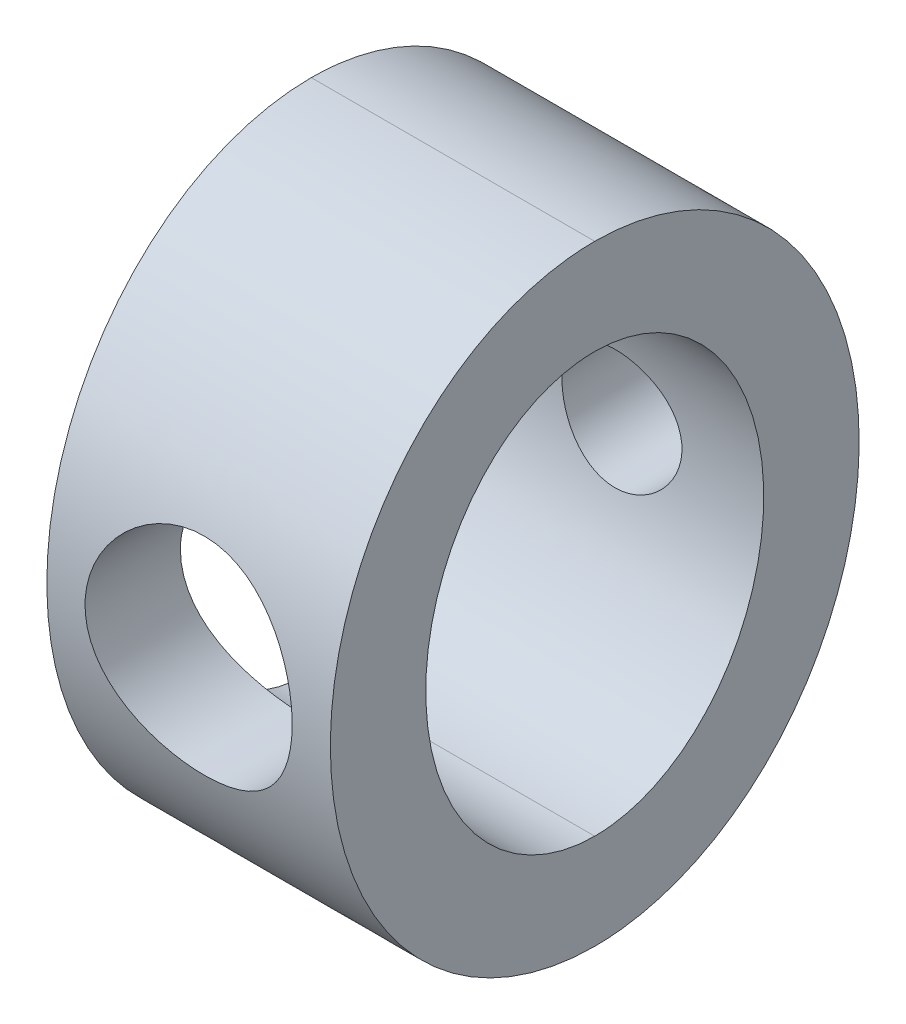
ISO-10303-21;
HEADER;
FILE_DESCRIPTION(('STEP AP214'),'2;1');
FILE_NAME('part.step','',(''),(''),'','','');
FILE_SCHEMA(('AUTOMOTIVE_DESIGN { 1 0 10303 214 1 1 1 1 }'));
ENDSEC;
DATA;
#1=APPLICATION_CONTEXT('core data for automotive mechanical design processes');
#2=APPLICATION_PROTOCOL_DEFINITION('international standard','automotive_design',2000,#1);
#3=PRODUCT_CONTEXT('',#1,'mechanical');
#4=PRODUCT('Part','Part','',(#3));
#5=PRODUCT_RELATED_PRODUCT_CATEGORY('part','',(#4));
#6=PRODUCT_DEFINITION_FORMATION('','',#4);
#7=PRODUCT_DEFINITION_CONTEXT('part definition',#1,'design');
#8=PRODUCT_DEFINITION('design','',#6,#7);
#9=PRODUCT_DEFINITION_SHAPE('','',#8);
#10=(LENGTH_UNIT() NAMED_UNIT(*) SI_UNIT(.MILLI.,.METRE.));
#11=(NAMED_UNIT(*) PLANE_ANGLE_UNIT() SI_UNIT($,.RADIAN.));
#12=(NAMED_UNIT(*) SI_UNIT($,.STERADIAN.) SOLID_ANGLE_UNIT());
#13=UNCERTAINTY_MEASURE_WITH_UNIT(LENGTH_MEASURE(1.E-05),#10,'distance_accuracy_value','');
#14=(GEOMETRIC_REPRESENTATION_CONTEXT(3) GLOBAL_UNCERTAINTY_ASSIGNED_CONTEXT((#13)) GLOBAL_UNIT_ASSIGNED_CONTEXT((#10,
#11,#12)) REPRESENTATION_CONTEXT('',''));
#15=CARTESIAN_POINT('',(0.,0.,0.));
#16=DIRECTION('',(0.,0.,1.));
#17=DIRECTION('',(1.,0.,0.));
#18=AXIS2_PLACEMENT_3D('',#15,#16,#17);
#19=CARTESIAN_POINT('',(-6.604,-9.779,12.319));
#20=CARTESIAN_POINT('',(6.604,-9.779,12.319));
#21=CARTESIAN_POINT('',(-6.60399999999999,-9.779,-3.429));
#22=CARTESIAN_POINT('',(6.604,-9.779,-3.429));
#23=CARTESIAN_POINT('',(-6.60399999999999,9.77899999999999,-3.429));
#24=CARTESIAN_POINT('',(6.604,9.77899999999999,-3.429));
#25=CARTESIAN_POINT('',(-6.604,9.779,12.319));
#26=CARTESIAN_POINT('',(6.604,9.779,12.319));
#27=(BOUNDED_SURFACE() B_SPLINE_SURFACE(3,1,((#19,#20),(#21,#22),(#23,#24),(#25,#26)),
.UNSPECIFIED.,.F.,.F.,.F.) B_SPLINE_SURFACE_WITH_KNOTS((4,4),(2,2),(0.,1.),(0.,1.),
.UNSPECIFIED.) GEOMETRIC_REPRESENTATION_ITEM() RATIONAL_B_SPLINE_SURFACE(((1.,1.),
(0.333333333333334,0.333333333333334),(0.333333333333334,0.333333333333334),(1.,1.))) REPRESENTATION_ITEM('') SURFACE());
#28=CARTESIAN_POINT('',(-2.794,0.,4.445));
#29=CARTESIAN_POINT('',(-2.79399228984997,0.154569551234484,4.44500411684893));
#30=CARTESIAN_POINT('',(-2.78111727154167,0.309324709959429,4.44798314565));
#31=CARTESIAN_POINT('',(-2.72997928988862,0.614557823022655,4.45959699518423));
#32=CARTESIAN_POINT('',(-2.69166760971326,0.765026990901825,4.46824266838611));
#33=CARTESIAN_POINT('',(-2.59092886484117,1.057037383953,4.49024610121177));
#34=CARTESIAN_POINT('',(-2.52853996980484,1.19859232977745,4.5035963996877));
#35=CARTESIAN_POINT('',(-2.38152732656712,1.46917511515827,4.53359309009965));
#36=CARTESIAN_POINT('',(-2.29690998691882,1.59820655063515,4.55023853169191));
#37=CARTESIAN_POINT('',(-2.10625097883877,1.84242179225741,4.58535767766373));
#38=CARTESIAN_POINT('',(-1.99989014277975,1.95735288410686,4.60385623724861));
#39=CARTESIAN_POINT('',(-1.76944183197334,2.16792049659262,4.64043875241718));
#40=CARTESIAN_POINT('',(-1.64535158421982,2.26355399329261,4.65852264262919));
#41=CARTESIAN_POINT('',(-1.38102791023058,2.43397460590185,4.69246451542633));
#42=CARTESIAN_POINT('',(-1.24060950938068,2.5084816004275,4.70829131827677));
#43=CARTESIAN_POINT('',(-0.948818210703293,2.63273909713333,4.73554800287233));
#44=CARTESIAN_POINT('',(-0.797446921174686,2.68249322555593,4.74697852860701));
#45=CARTESIAN_POINT('',(-0.490814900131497,2.7549816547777,4.76387248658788));
#46=CARTESIAN_POINT('',(-0.335666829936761,2.77816870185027,4.76943577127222));
#47=CARTESIAN_POINT('',(-0.0235908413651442,2.79827083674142,4.77424989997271));
#48=CARTESIAN_POINT('',(0.133336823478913,2.79518962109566,4.77350163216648));
#49=CARTESIAN_POINT('',(0.441025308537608,2.76321506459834,4.76587187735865));
#50=CARTESIAN_POINT('',(0.591846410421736,2.73486616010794,4.75911976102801));
#51=CARTESIAN_POINT('',(0.886533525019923,2.6540239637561,4.74046353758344));
#52=CARTESIAN_POINT('',(1.03039902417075,2.60152889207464,4.72855905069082));
#53=CARTESIAN_POINT('',(1.30860224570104,2.47339170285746,4.70083619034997));
#54=CARTESIAN_POINT('',(1.4428413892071,2.39754336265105,4.68498319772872));
#55=CARTESIAN_POINT('',(1.69687719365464,2.22500044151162,4.65119139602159));
#56=CARTESIAN_POINT('',(1.816672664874,2.12830414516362,4.63325241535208));
#57=CARTESIAN_POINT('',(2.04150860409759,1.91399659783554,4.59677798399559));
#58=CARTESIAN_POINT('',(2.14611613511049,1.79593133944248,4.5782386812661));
#59=CARTESIAN_POINT('',(2.33416275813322,1.54365621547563,4.54303862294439));
#60=CARTESIAN_POINT('',(2.41759274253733,1.40943944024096,4.52637867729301));
#61=CARTESIAN_POINT('',(2.56101466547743,1.12812092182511,4.49673376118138));
#62=CARTESIAN_POINT('',(2.620933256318,0.980980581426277,4.48376032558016));
#63=CARTESIAN_POINT('',(2.71495943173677,0.678535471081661,4.46303246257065));
#64=CARTESIAN_POINT('',(2.74912084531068,0.523248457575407,4.45526715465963));
#65=CARTESIAN_POINT('',(2.77791489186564,0.305600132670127,4.44869221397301));
#66=CARTESIAN_POINT('',(2.78394124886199,0.244652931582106,4.44731086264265));
#67=CARTESIAN_POINT('',(2.79198533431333,0.122480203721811,4.44546393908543));
#68=CARTESIAN_POINT('',(2.79400305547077,0.0612546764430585,4.44499836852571));
#69=CARTESIAN_POINT('',(2.79399228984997,-0.154569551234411,4.44500411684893));
#70=CARTESIAN_POINT('',(2.78111727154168,-0.309324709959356,4.44798314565));
#71=CARTESIAN_POINT('',(2.72997928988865,-0.614557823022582,4.45959699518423));
#72=CARTESIAN_POINT('',(2.69166760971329,-0.765026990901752,4.46824266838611));
#73=CARTESIAN_POINT('',(2.5909288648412,-1.05703738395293,4.49024610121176));
#74=CARTESIAN_POINT('',(2.52853996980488,-1.19859232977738,4.50359639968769));
#75=CARTESIAN_POINT('',(2.38152732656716,-1.4691751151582,4.53359309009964));
#76=CARTESIAN_POINT('',(2.29690998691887,-1.59820655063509,4.5502385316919));
#77=CARTESIAN_POINT('',(2.10625097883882,-1.84242179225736,4.58535767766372));
#78=CARTESIAN_POINT('',(1.99989014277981,-1.95735288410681,4.6038562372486));
#79=CARTESIAN_POINT('',(1.7694418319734,-2.16792049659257,4.64043875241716));
#80=CARTESIAN_POINT('',(1.64535158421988,-2.26355399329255,4.65852264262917));
#81=CARTESIAN_POINT('',(1.38102791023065,-2.43397460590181,4.69246451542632));
#82=CARTESIAN_POINT('',(1.24060950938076,-2.50848160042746,4.70829131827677));
#83=CARTESIAN_POINT('',(0.948818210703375,-2.6327390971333,4.73554800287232));
#84=CARTESIAN_POINT('',(0.797446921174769,-2.68249322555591,4.746978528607));
#85=CARTESIAN_POINT('',(0.490814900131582,-2.75498165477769,4.76387248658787));
#86=CARTESIAN_POINT('',(0.335666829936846,-2.77816870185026,4.76943577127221));
#87=CARTESIAN_POINT('',(0.0235908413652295,-2.79827083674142,4.77424989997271));
#88=CARTESIAN_POINT('',(-0.133336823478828,-2.79518962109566,4.77350163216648));
#89=CARTESIAN_POINT('',(-0.441025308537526,-2.76321506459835,4.76587187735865));
#90=CARTESIAN_POINT('',(-0.591846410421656,-2.73486616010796,4.75911976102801));
#91=CARTESIAN_POINT('',(-0.886533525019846,-2.65402396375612,4.74046353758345));
#92=CARTESIAN_POINT('',(-1.03039902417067,-2.60152889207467,4.72855905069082));
#93=CARTESIAN_POINT('',(-1.30860224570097,-2.47339170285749,4.70083619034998));
#94=CARTESIAN_POINT('',(-1.44284138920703,-2.39754336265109,4.68498319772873));
#95=CARTESIAN_POINT('',(-1.69687719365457,-2.22500044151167,4.65119139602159));
#96=CARTESIAN_POINT('',(-1.81667266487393,-2.12830414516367,4.63325241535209));
#97=CARTESIAN_POINT('',(-2.04150860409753,-1.9139965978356,4.5967779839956));
#98=CARTESIAN_POINT('',(-2.14611613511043,-1.79593133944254,4.57823868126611));
#99=CARTESIAN_POINT('',(-2.33416275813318,-1.54365621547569,4.5430386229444));
#100=CARTESIAN_POINT('',(-2.41759274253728,-1.40943944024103,4.52637867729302));
#101=CARTESIAN_POINT('',(-2.5610146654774,-1.12812092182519,4.49673376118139));
#102=CARTESIAN_POINT('',(-2.62093325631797,-0.980980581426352,4.48376032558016));
#103=CARTESIAN_POINT('',(-2.71495943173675,-0.678535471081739,4.46303246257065));
#104=CARTESIAN_POINT('',(-2.74912084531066,-0.523248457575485,4.45526715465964));
#105=CARTESIAN_POINT('',(-2.77791489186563,-0.305600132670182,4.44869221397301));
#106=CARTESIAN_POINT('',(-2.78394124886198,-0.244652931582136,4.44731086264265));
#107=CARTESIAN_POINT('',(-2.79198533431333,-0.12248020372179,4.44546393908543));
#108=CARTESIAN_POINT('',(-2.79400305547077,-0.061254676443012,4.44499836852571));
#109=CARTESIAN_POINT('',(-2.794,0.,4.445));
#110=B_SPLINE_CURVE_WITH_KNOTS('',3,(#28,#29,#30,#31,#32,#33,#34,#35,#36,#37,#38,#39,#40,#41,
#42,#43,#44,#45,#46,#47,#48,#49,#50,#51,#52,#53,#54,#55,#56,#57,#58,#59,#60,#61,#62,#63,#64,#65,
#66,#67,#68,#69,#70,#71,#72,#73,#74,#75,#76,#77,#78,#79,#80,#81,#82,#83,#84,#85,#86,#87,#88,#89,
#90,#91,#92,#93,#94,#95,#96,#97,#98,#99,#100,#101,#102,#103,#104,#105,#106,#107,#108,#109),
.UNSPECIFIED.,.T.,.F.,(4,2,2,2,2,2,2,2,2,2,2,2,2,2,2,2,2,2,2,2,2,2,2,2,2,2,2,2,2,2,2,2,2,2,2,2,
2,2,2,2,4),(0.,0.463474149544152,0.927838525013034,1.39146974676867,1.85496744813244,
2.32583260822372,2.79677149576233,3.27369024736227,3.75053911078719,4.2191348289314,
4.68766460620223,5.14633678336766,5.6050427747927,6.06792157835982,6.53083848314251,
7.0050863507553,7.47953782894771,7.95545788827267,8.43038056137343,8.61405132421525,
8.79772242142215,9.26119657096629,9.72556094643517,10.1891921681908,10.6526898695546,
11.1235550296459,11.5944939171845,12.0714126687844,12.5482615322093,13.0168572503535,
13.4853870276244,13.9440592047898,14.4027651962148,14.865643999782,15.3285609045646,
15.8028087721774,16.2772602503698,16.7531803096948,17.2281029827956,17.4117737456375,
17.5954448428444),.UNSPECIFIED.);
#111=CARTESIAN_POINT('',(-2.794,0.,4.445));
#112=VERTEX_POINT('',#111);
#113=EDGE_CURVE('E75',#112,#112,#110,.T.);
#114=DIRECTION('',(1.,0.,0.));
#115=VECTOR('',#114,1.);
#116=CARTESIAN_POINT('',(0.,-9.779,12.319));
#117=LINE('',#116,#115);
#118=CARTESIAN_POINT('',(-6.604,-9.779,12.319));
#119=VERTEX_POINT('',#118);
#120=CARTESIAN_POINT('',(6.604,-9.779,12.319));
#121=VERTEX_POINT('',#120);
#122=EDGE_CURVE('E58',#119,#121,#117,.T.);
#123=CARTESIAN_POINT('',(6.604,9.779,12.319));
#124=CARTESIAN_POINT('',(6.604,9.77904573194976,12.1322895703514));
#125=CARTESIAN_POINT('',(6.604,9.77075438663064,11.945596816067));
#126=CARTESIAN_POINT('',(6.604,9.73783801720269,11.573736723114));
#127=CARTESIAN_POINT('',(6.604,9.71322019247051,11.3885687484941));
#128=CARTESIAN_POINT('',(6.604,9.64816463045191,11.0220606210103));
#129=CARTESIAN_POINT('',(6.604,9.60781191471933,10.8407053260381));
#130=CARTESIAN_POINT('',(6.604,9.51189382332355,10.482060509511));
#131=CARTESIAN_POINT('',(6.604,9.45632741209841,10.3047712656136));
#132=CARTESIAN_POINT('',(6.604,9.33086313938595,9.9556906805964));
#133=CARTESIAN_POINT('',(6.604,9.26098968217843,9.78389054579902));
#134=CARTESIAN_POINT('',(6.604,9.10772819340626,9.44636649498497));
#135=CARTESIAN_POINT('',(6.604,9.02433516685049,9.2806448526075));
#136=CARTESIAN_POINT('',(6.604,8.84497076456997,8.95601747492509));
#137=CARTESIAN_POINT('',(6.604,8.74899061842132,8.79711659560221));
#138=CARTESIAN_POINT('',(6.604,8.54548304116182,8.48682519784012));
#139=CARTESIAN_POINT('',(6.604,8.43795120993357,8.33543757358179));
#140=CARTESIAN_POINT('',(6.604,8.2025198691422,8.02782189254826));
#141=CARTESIAN_POINT('',(6.604,8.07366163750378,7.87232715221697));
#142=CARTESIAN_POINT('',(6.604,7.80478652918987,7.57127017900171));
#143=CARTESIAN_POINT('',(6.604,7.66476563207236,7.42571156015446));
#144=CARTESIAN_POINT('',(6.604,7.22982680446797,7.00447228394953));
#145=CARTESIAN_POINT('',(6.604,6.91991847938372,6.7440811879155));
#146=CARTESIAN_POINT('',(6.604,6.20990460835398,6.22193614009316));
#147=CARTESIAN_POINT('',(6.604,5.80365815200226,5.96859874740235));
#148=CARTESIAN_POINT('',(6.604,4.95995000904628,5.52078695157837));
#149=CARTESIAN_POINT('',(6.604,4.52246861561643,5.32635012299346));
#150=CARTESIAN_POINT('',(6.604,3.538299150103,4.96316143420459));
#151=CARTESIAN_POINT('',(6.604,2.98700359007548,4.80689814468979));
#152=CARTESIAN_POINT('',(6.604,1.86735259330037,4.57588799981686));
#153=CARTESIAN_POINT('',(6.604,1.29898670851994,4.50119215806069));
#154=CARTESIAN_POINT('',(6.604,0.401182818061,4.44719274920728));
#155=CARTESIAN_POINT('',(6.604,0.0731562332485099,4.44080111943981));
#156=CARTESIAN_POINT('',(6.604,-0.582345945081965,4.45453688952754));
#157=CARTESIAN_POINT('',(6.604,-0.909821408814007,4.47466984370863));
#158=CARTESIAN_POINT('',(6.604,-1.88891417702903,4.57516095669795));
#159=CARTESIAN_POINT('',(6.604,-2.53714678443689,4.69561444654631));
#160=CARTESIAN_POINT('',(6.604,-3.49584819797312,4.96007521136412));
#161=CARTESIAN_POINT('',(6.604,-3.81784300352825,5.06441748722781));
#162=CARTESIAN_POINT('',(6.604,-4.45109421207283,5.30231284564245));
#163=CARTESIAN_POINT('',(6.604,-4.76234884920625,5.4358707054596));
#164=CARTESIAN_POINT('',(6.604,-5.36991483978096,5.73219011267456));
#165=CARTESIAN_POINT('',(6.604,-5.66625343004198,5.89489575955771));
#166=CARTESIAN_POINT('',(6.604,-6.24064267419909,6.24983311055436));
#167=CARTESIAN_POINT('',(6.604,-6.51870299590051,6.44204902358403));
#168=CARTESIAN_POINT('',(6.604,-6.96395661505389,6.78749832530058));
#169=CARTESIAN_POINT('',(6.604,-7.1374537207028,6.93266177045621));
#170=CARTESIAN_POINT('',(6.604,-7.47268538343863,7.23597257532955));
#171=CARTESIAN_POINT('',(6.604,-7.63442273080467,7.3941168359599));
#172=CARTESIAN_POINT('',(6.604,-7.94447233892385,7.72304131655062));
#173=CARTESIAN_POINT('',(6.604,-8.09278663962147,7.89381960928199));
#174=CARTESIAN_POINT('',(6.604,-8.37425167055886,8.24748593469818));
#175=CARTESIAN_POINT('',(6.604,-8.50740215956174,8.4303741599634));
#176=CARTESIAN_POINT('',(6.604,-8.75790786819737,8.80927267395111));
#177=CARTESIAN_POINT('',(6.604,-8.87509654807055,9.00539345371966));
#178=CARTESIAN_POINT('',(6.604,-9.09020959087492,9.40791743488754));
#179=CARTESIAN_POINT('',(6.604,-9.18813755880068,9.61431870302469));
#180=CARTESIAN_POINT('',(6.604,-9.36279186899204,10.0354762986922));
#181=CARTESIAN_POINT('',(6.604,-9.43955807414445,10.2502160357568));
#182=CARTESIAN_POINT('',(6.604,-9.57052946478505,10.6863448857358));
#183=CARTESIAN_POINT('',(6.604,-9.62474927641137,10.9077295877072));
#184=CARTESIAN_POINT('',(6.604,-9.70420673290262,11.3270563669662));
#185=CARTESIAN_POINT('',(6.604,-9.73221898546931,11.5244716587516));
#186=CARTESIAN_POINT('',(6.604,-9.76026673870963,11.8218052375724));
#187=CARTESIAN_POINT('',(6.604,-9.76728754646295,11.9211037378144));
#188=CARTESIAN_POINT('',(6.604,-9.77665524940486,12.1199302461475));
#189=CARTESIAN_POINT('',(6.604,-9.7790017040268,12.2194582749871));
#190=CARTESIAN_POINT('',(6.604,-9.779,12.319));
#191=B_SPLINE_CURVE_WITH_KNOTS('',3,(#123,#124,#125,#126,#127,#128,#129,#130,#131,#132,#133,
#134,#135,#136,#137,#138,#139,#140,#141,#142,#143,#144,#145,#146,#147,#148,#149,#150,#151,#152,
#153,#154,#155,#156,#157,#158,#159,#160,#161,#162,#163,#164,#165,#166,#167,#168,#169,#170,#171,
#172,#173,#174,#175,#176,#177,#178,#179,#180,#181,#182,#183,#184,#185,#186,#187,#188,#189,#190),
.UNSPECIFIED.,.F.,.F.,(4,2,2,2,2,2,2,2,2,2,2,2,2,2,2,2,2,2,2,2,2,2,2,2,2,2,2,2,2,2,2,2,2,4),(0.,
0.559919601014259,1.1195924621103,1.67628219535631,2.23300983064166,2.78879562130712,
3.34478722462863,3.90116830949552,4.4577620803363,5.06300102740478,5.66845895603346,
6.87882145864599,8.30997986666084,9.74204934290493,11.4545912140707,13.1682035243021,
14.1514683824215,15.1349391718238,17.1020325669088,18.1163790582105,19.1308915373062,
20.1434787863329,21.1555260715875,21.833576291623,22.5114650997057,23.1892507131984,
23.8670471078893,24.5514475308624,25.2357197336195,25.9186940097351,26.6012245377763,
27.1984820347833,27.4970243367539,27.7955947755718),.UNSPECIFIED.);
#192=CARTESIAN_POINT('',(6.604,9.779,12.319));
#193=VERTEX_POINT('',#192);
#194=EDGE_CURVE('E68',#193,#121,#191,.T.);
#195=DIRECTION('',(-1.,0.,0.));
#196=VECTOR('',#195,1.);
#197=CARTESIAN_POINT('',(0.,9.779,12.319));
#198=LINE('',#197,#196);
#199=CARTESIAN_POINT('',(-6.604,9.779,12.319));
#200=VERTEX_POINT('',#199);
#201=EDGE_CURVE('E63',#193,#200,#198,.T.);
#202=CARTESIAN_POINT('',(-6.604,9.779,12.319));
#203=CARTESIAN_POINT('',(-6.604,9.77904573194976,12.1322895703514));
#204=CARTESIAN_POINT('',(-6.604,9.77075438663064,11.945596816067));
#205=CARTESIAN_POINT('',(-6.604,9.7378380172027,11.573736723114));
#206=CARTESIAN_POINT('',(-6.604,9.71322019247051,11.3885687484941));
#207=CARTESIAN_POINT('',(-6.604,9.64816463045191,11.0220606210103));
#208=CARTESIAN_POINT('',(-6.604,9.60781191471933,10.8407053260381));
#209=CARTESIAN_POINT('',(-6.604,9.51189382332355,10.482060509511));
#210=CARTESIAN_POINT('',(-6.604,9.45632741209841,10.3047712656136));
#211=CARTESIAN_POINT('',(-6.604,9.33086313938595,9.9556906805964));
#212=CARTESIAN_POINT('',(-6.604,9.26098968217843,9.78389054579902));
#213=CARTESIAN_POINT('',(-6.604,9.10772819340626,9.44636649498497));
#214=CARTESIAN_POINT('',(-6.604,9.02433516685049,9.2806448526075));
#215=CARTESIAN_POINT('',(-6.604,8.84497076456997,8.95601747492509));
#216=CARTESIAN_POINT('',(-6.604,8.74899061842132,8.79711659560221));
#217=CARTESIAN_POINT('',(-6.604,8.54548304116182,8.48682519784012));
#218=CARTESIAN_POINT('',(-6.604,8.43795120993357,8.33543757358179));
#219=CARTESIAN_POINT('',(-6.604,8.2025198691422,8.02782189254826));
#220=CARTESIAN_POINT('',(-6.604,8.07366163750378,7.87232715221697));
#221=CARTESIAN_POINT('',(-6.604,7.80478652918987,7.57127017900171));
#222=CARTESIAN_POINT('',(-6.604,7.66476563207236,7.42571156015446));
#223=CARTESIAN_POINT('',(-6.604,7.22982680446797,7.00447228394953));
#224=CARTESIAN_POINT('',(-6.604,6.91991847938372,6.7440811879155));
#225=CARTESIAN_POINT('',(-6.604,6.20990460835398,6.22193614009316));
#226=CARTESIAN_POINT('',(-6.604,5.80365815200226,5.96859874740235));
#227=CARTESIAN_POINT('',(-6.604,4.95995000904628,5.52078695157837));
#228=CARTESIAN_POINT('',(-6.604,4.52246861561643,5.32635012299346));
#229=CARTESIAN_POINT('',(-6.604,3.538299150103,4.96316143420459));
#230=CARTESIAN_POINT('',(-6.604,2.98700359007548,4.8068981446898));
#231=CARTESIAN_POINT('',(-6.604,1.86735259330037,4.57588799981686));
#232=CARTESIAN_POINT('',(-6.604,1.29898670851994,4.50119215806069));
#233=CARTESIAN_POINT('',(-6.604,0.401182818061,4.44719274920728));
#234=CARTESIAN_POINT('',(-6.604,0.0731562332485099,4.44080111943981));
#235=CARTESIAN_POINT('',(-6.604,-0.582345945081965,4.45453688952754));
#236=CARTESIAN_POINT('',(-6.604,-0.909821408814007,4.47466984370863));
#237=CARTESIAN_POINT('',(-6.604,-1.88891417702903,4.57516095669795));
#238=CARTESIAN_POINT('',(-6.604,-2.53714678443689,4.69561444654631));
#239=CARTESIAN_POINT('',(-6.604,-3.49584819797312,4.96007521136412));
#240=CARTESIAN_POINT('',(-6.604,-3.81784300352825,5.06441748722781));
#241=CARTESIAN_POINT('',(-6.604,-4.45109421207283,5.30231284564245));
#242=CARTESIAN_POINT('',(-6.604,-4.76234884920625,5.4358707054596));
#243=CARTESIAN_POINT('',(-6.604,-5.36991483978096,5.73219011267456));
#244=CARTESIAN_POINT('',(-6.604,-5.66625343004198,5.89489575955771));
#245=CARTESIAN_POINT('',(-6.604,-6.24064267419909,6.24983311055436));
#246=CARTESIAN_POINT('',(-6.604,-6.51870299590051,6.44204902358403));
#247=CARTESIAN_POINT('',(-6.604,-6.96395661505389,6.78749832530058));
#248=CARTESIAN_POINT('',(-6.604,-7.1374537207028,6.93266177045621));
#249=CARTESIAN_POINT('',(-6.604,-7.47268538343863,7.23597257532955));
#250=CARTESIAN_POINT('',(-6.604,-7.63442273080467,7.3941168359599));
#251=CARTESIAN_POINT('',(-6.604,-7.94447233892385,7.72304131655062));
#252=CARTESIAN_POINT('',(-6.604,-8.09278663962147,7.89381960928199));
#253=CARTESIAN_POINT('',(-6.604,-8.37425167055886,8.24748593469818));
#254=CARTESIAN_POINT('',(-6.604,-8.50740215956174,8.4303741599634));
#255=CARTESIAN_POINT('',(-6.604,-8.75790786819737,8.80927267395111));
#256=CARTESIAN_POINT('',(-6.604,-8.87509654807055,9.00539345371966));
#257=CARTESIAN_POINT('',(-6.604,-9.09020959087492,9.40791743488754));
#258=CARTESIAN_POINT('',(-6.604,-9.18813755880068,9.61431870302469));
#259=CARTESIAN_POINT('',(-6.604,-9.36279186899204,10.0354762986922));
#260=CARTESIAN_POINT('',(-6.604,-9.43955807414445,10.2502160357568));
#261=CARTESIAN_POINT('',(-6.604,-9.57052946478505,10.6863448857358));
#262=CARTESIAN_POINT('',(-6.604,-9.62474927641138,10.9077295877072));
#263=CARTESIAN_POINT('',(-6.604,-9.70420673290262,11.3270563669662));
#264=CARTESIAN_POINT('',(-6.604,-9.7322189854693,11.5244716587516));
#265=CARTESIAN_POINT('',(-6.604,-9.76026673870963,11.8218052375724));
#266=CARTESIAN_POINT('',(-6.604,-9.76728754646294,11.9211037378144));
#267=CARTESIAN_POINT('',(-6.604,-9.77665524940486,12.1199302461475));
#268=CARTESIAN_POINT('',(-6.604,-9.7790017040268,12.2194582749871));
#269=CARTESIAN_POINT('',(-6.604,-9.779,12.319));
#270=B_SPLINE_CURVE_WITH_KNOTS('',3,(#202,#203,#204,#205,#206,#207,#208,#209,#210,#211,#212,
#213,#214,#215,#216,#217,#218,#219,#220,#221,#222,#223,#224,#225,#226,#227,#228,#229,#230,#231,
#232,#233,#234,#235,#236,#237,#238,#239,#240,#241,#242,#243,#244,#245,#246,#247,#248,#249,#250,
#251,#252,#253,#254,#255,#256,#257,#258,#259,#260,#261,#262,#263,#264,#265,#266,#267,#268,#269),
.UNSPECIFIED.,.F.,.F.,(4,2,2,2,2,2,2,2,2,2,2,2,2,2,2,2,2,2,2,2,2,2,2,2,2,2,2,2,2,2,2,2,2,4),(0.,
0.559919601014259,1.1195924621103,1.67628219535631,2.23300983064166,2.78879562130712,
3.34478722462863,3.90116830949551,4.4577620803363,5.06300102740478,5.66845895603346,
6.87882145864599,8.30997986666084,9.74204934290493,11.4545912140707,13.1682035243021,
14.1514683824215,15.1349391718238,17.1020325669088,18.1163790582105,19.1308915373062,
20.1434787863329,21.1555260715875,21.833576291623,22.5114650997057,23.1892507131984,
23.8670471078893,24.5514475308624,25.2357197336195,25.9186940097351,26.6012245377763,
27.1984820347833,27.4970243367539,27.7955947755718),.UNSPECIFIED.);
#271=EDGE_CURVE('E65',#200,#119,#270,.T.);
#272=ORIENTED_EDGE('',*,*,#113,.T.);
#273=EDGE_LOOP('',(#272));
#274=FACE_BOUND('',#273,.T.);
#275=ORIENTED_EDGE('',*,*,#122,.T.);
#276=ORIENTED_EDGE('',*,*,#194,.F.);
#277=ORIENTED_EDGE('',*,*,#201,.T.);
#278=ORIENTED_EDGE('',*,*,#271,.T.);
#279=EDGE_LOOP('',(#275,#276,#277,#278));
#280=FACE_BOUND('',#279,.T.);
#281=ADVANCED_FACE('F14',(#274,#280),#27,.F.);
#282=CARTESIAN_POINT('',(-6.604,9.779,12.319));
#283=CARTESIAN_POINT('',(6.604,9.779,12.319));
#284=CARTESIAN_POINT('',(-6.60399999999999,9.779,28.067));
#285=CARTESIAN_POINT('',(6.604,9.779,28.067));
#286=CARTESIAN_POINT('',(-6.60399999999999,-9.779,28.067));
#287=CARTESIAN_POINT('',(6.604,-9.779,28.067));
#288=CARTESIAN_POINT('',(-6.604,-9.779,12.319));
#289=CARTESIAN_POINT('',(6.604,-9.779,12.319));
#290=(BOUNDED_SURFACE() B_SPLINE_SURFACE(3,1,((#282,#283),(#284,#285),(#286,#287),(#288,#289)),
.UNSPECIFIED.,.F.,.F.,.F.) B_SPLINE_SURFACE_WITH_KNOTS((4,4),(2,2),(0.,1.),(0.,1.),
.UNSPECIFIED.) GEOMETRIC_REPRESENTATION_ITEM() RATIONAL_B_SPLINE_SURFACE(((1.,1.),
(0.333333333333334,0.333333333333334),(0.333333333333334,0.333333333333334),(1.,1.))) REPRESENTATION_ITEM('') SURFACE());
#291=CARTESIAN_POINT('',(-6.604,-9.779,12.319));
#292=CARTESIAN_POINT('',(-6.604,-9.77904573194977,12.5057104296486));
#293=CARTESIAN_POINT('',(-6.604,-9.77075438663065,12.692403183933));
#294=CARTESIAN_POINT('',(-6.604,-9.7378380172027,13.0642632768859));
#295=CARTESIAN_POINT('',(-6.604,-9.71322019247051,13.2494312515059));
#296=CARTESIAN_POINT('',(-6.604,-9.64816463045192,13.6159393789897));
#297=CARTESIAN_POINT('',(-6.604,-9.60781191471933,13.7972946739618));
#298=CARTESIAN_POINT('',(-6.604,-9.51189382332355,14.155939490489));
#299=CARTESIAN_POINT('',(-6.604,-9.45632741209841,14.3332287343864));
#300=CARTESIAN_POINT('',(-6.604,-9.33086313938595,14.6823093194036));
#301=CARTESIAN_POINT('',(-6.604,-9.26098968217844,14.854109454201));
#302=CARTESIAN_POINT('',(-6.604,-9.10772819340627,15.191633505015));
#303=CARTESIAN_POINT('',(-6.604,-9.02433516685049,15.3573551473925));
#304=CARTESIAN_POINT('',(-6.604,-8.84497076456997,15.6819825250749));
#305=CARTESIAN_POINT('',(-6.604,-8.74899061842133,15.8408834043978));
#306=CARTESIAN_POINT('',(-6.604,-8.54548304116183,16.1511748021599));
#307=CARTESIAN_POINT('',(-6.604,-8.43795120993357,16.3025624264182));
#308=CARTESIAN_POINT('',(-6.604,-8.2025198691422,16.6101781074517));
#309=CARTESIAN_POINT('',(-6.604,-8.07366163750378,16.765672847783));
#310=CARTESIAN_POINT('',(-6.604,-7.80478652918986,17.0667298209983));
#311=CARTESIAN_POINT('',(-6.604,-7.66476563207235,17.2122884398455));
#312=CARTESIAN_POINT('',(-6.604,-7.22982680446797,17.6335277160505));
#313=CARTESIAN_POINT('',(-6.604,-6.91991847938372,17.8939188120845));
#314=CARTESIAN_POINT('',(-6.604,-6.20990460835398,18.4160638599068));
#315=CARTESIAN_POINT('',(-6.604,-5.80365815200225,18.6694012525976));
#316=CARTESIAN_POINT('',(-6.604,-4.95995000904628,19.1172130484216));
#317=CARTESIAN_POINT('',(-6.604,-4.52246861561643,19.3116498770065));
#318=CARTESIAN_POINT('',(-6.604,-3.538299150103,19.6748385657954));
#319=CARTESIAN_POINT('',(-6.604,-2.98700359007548,19.8311018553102));
#320=CARTESIAN_POINT('',(-6.604,-1.86735259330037,20.0621120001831));
#321=CARTESIAN_POINT('',(-6.604,-1.29898670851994,20.1368078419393));
#322=CARTESIAN_POINT('',(-6.604,-0.401182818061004,20.1908072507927));
#323=CARTESIAN_POINT('',(-6.604,-0.073156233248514,20.1971988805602));
#324=CARTESIAN_POINT('',(-6.604,0.582345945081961,20.1834631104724));
#325=CARTESIAN_POINT('',(-6.604,0.909821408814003,20.1633301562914));
#326=CARTESIAN_POINT('',(-6.604,1.88891417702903,20.062839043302));
#327=CARTESIAN_POINT('',(-6.604,2.53714678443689,19.9423855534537));
#328=CARTESIAN_POINT('',(-6.604,3.49584819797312,19.6779247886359));
#329=CARTESIAN_POINT('',(-6.604,3.81784300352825,19.5735825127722));
#330=CARTESIAN_POINT('',(-6.604,4.45109421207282,19.3356871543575));
#331=CARTESIAN_POINT('',(-6.604,4.76234884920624,19.2021292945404));
#332=CARTESIAN_POINT('',(-6.604,5.36991483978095,18.9058098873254));
#333=CARTESIAN_POINT('',(-6.604,5.66625343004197,18.7431042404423));
#334=CARTESIAN_POINT('',(-6.604,6.24064267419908,18.3881668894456));
#335=CARTESIAN_POINT('',(-6.604,6.5187029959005,18.195950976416));
#336=CARTESIAN_POINT('',(-6.604,6.96395661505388,17.8505016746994));
#337=CARTESIAN_POINT('',(-6.604,7.13745372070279,17.7053382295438));
#338=CARTESIAN_POINT('',(-6.604,7.47268538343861,17.4020274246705));
#339=CARTESIAN_POINT('',(-6.604,7.63442273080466,17.2438831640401));
#340=CARTESIAN_POINT('',(-6.604,7.94447233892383,16.9149586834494));
#341=CARTESIAN_POINT('',(-6.604,8.09278663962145,16.744180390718));
#342=CARTESIAN_POINT('',(-6.604,8.37425167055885,16.3905140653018));
#343=CARTESIAN_POINT('',(-6.604,8.50740215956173,16.2076258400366));
#344=CARTESIAN_POINT('',(-6.604,8.75790786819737,15.8287273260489));
#345=CARTESIAN_POINT('',(-6.604,8.87509654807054,15.6326065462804));
#346=CARTESIAN_POINT('',(-6.604,9.0902095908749,15.2300825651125));
#347=CARTESIAN_POINT('',(-6.604,9.18813755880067,15.0236812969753));
#348=CARTESIAN_POINT('',(-6.604,9.36279186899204,14.6025237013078));
#349=CARTESIAN_POINT('',(-6.604,9.43955807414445,14.3877839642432));
#350=CARTESIAN_POINT('',(-6.604,9.57052946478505,13.9516551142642));
#351=CARTESIAN_POINT('',(-6.604,9.62474927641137,13.7302704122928));
#352=CARTESIAN_POINT('',(-6.604,9.70420673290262,13.3109436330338));
#353=CARTESIAN_POINT('',(-6.604,9.7322189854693,13.1135283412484));
#354=CARTESIAN_POINT('',(-6.604,9.76026673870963,12.8161947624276));
#355=CARTESIAN_POINT('',(-6.604,9.76728754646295,12.7168962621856));
#356=CARTESIAN_POINT('',(-6.604,9.77665524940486,12.5180697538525));
#357=CARTESIAN_POINT('',(-6.604,9.77900170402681,12.4185417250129));
#358=CARTESIAN_POINT('',(-6.604,9.779,12.319));
#359=B_SPLINE_CURVE_WITH_KNOTS('',3,(#291,#292,#293,#294,#295,#296,#297,#298,#299,#300,#301,
#302,#303,#304,#305,#306,#307,#308,#309,#310,#311,#312,#313,#314,#315,#316,#317,#318,#319,#320,
#321,#322,#323,#324,#325,#326,#327,#328,#329,#330,#331,#332,#333,#334,#335,#336,#337,#338,#339,
#340,#341,#342,#343,#344,#345,#346,#347,#348,#349,#350,#351,#352,#353,#354,#355,#356,#357,#358),
.UNSPECIFIED.,.F.,.F.,(4,2,2,2,2,2,2,2,2,2,2,2,2,2,2,2,2,2,2,2,2,2,2,2,2,2,2,2,2,2,2,2,2,4),(0.,
0.559919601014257,1.11959246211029,1.6762821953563,2.23300983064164,2.78879562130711,
3.34478722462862,3.90116830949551,4.4577620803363,5.06300102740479,5.66845895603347,
6.87882145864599,8.30997986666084,9.74204934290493,11.4545912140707,13.1682035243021,
14.1514683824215,15.1349391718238,17.1020325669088,18.1163790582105,19.1308915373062,
20.1434787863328,21.1555260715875,21.833576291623,22.5114650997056,23.1892507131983,
23.8670471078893,24.5514475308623,25.2357197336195,25.9186940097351,26.6012245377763,
27.1984820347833,27.4970243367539,27.7955947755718),.UNSPECIFIED.);
#360=EDGE_CURVE('E71',#119,#200,#359,.T.);
#361=CARTESIAN_POINT('',(6.604,-9.779,12.319));
#362=CARTESIAN_POINT('',(6.604,-9.77904573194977,12.5057104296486));
#363=CARTESIAN_POINT('',(6.604,-9.77075438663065,12.692403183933));
#364=CARTESIAN_POINT('',(6.604,-9.7378380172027,13.0642632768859));
#365=CARTESIAN_POINT('',(6.604,-9.71322019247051,13.2494312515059));
#366=CARTESIAN_POINT('',(6.604,-9.64816463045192,13.6159393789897));
#367=CARTESIAN_POINT('',(6.604,-9.60781191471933,13.7972946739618));
#368=CARTESIAN_POINT('',(6.604,-9.51189382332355,14.155939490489));
#369=CARTESIAN_POINT('',(6.604,-9.45632741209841,14.3332287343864));
#370=CARTESIAN_POINT('',(6.604,-9.33086313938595,14.6823093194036));
#371=CARTESIAN_POINT('',(6.604,-9.26098968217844,14.854109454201));
#372=CARTESIAN_POINT('',(6.604,-9.10772819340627,15.191633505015));
#373=CARTESIAN_POINT('',(6.604,-9.02433516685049,15.3573551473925));
#374=CARTESIAN_POINT('',(6.604,-8.84497076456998,15.6819825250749));
#375=CARTESIAN_POINT('',(6.604,-8.74899061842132,15.8408834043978));
#376=CARTESIAN_POINT('',(6.604,-8.54548304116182,16.1511748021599));
#377=CARTESIAN_POINT('',(6.604,-8.43795120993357,16.3025624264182));
#378=CARTESIAN_POINT('',(6.604,-8.2025198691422,16.6101781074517));
#379=CARTESIAN_POINT('',(6.604,-8.07366163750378,16.765672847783));
#380=CARTESIAN_POINT('',(6.604,-7.80478652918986,17.0667298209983));
#381=CARTESIAN_POINT('',(6.604,-7.66476563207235,17.2122884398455));
#382=CARTESIAN_POINT('',(6.604,-7.22982680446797,17.6335277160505));
#383=CARTESIAN_POINT('',(6.604,-6.91991847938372,17.8939188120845));
#384=CARTESIAN_POINT('',(6.604,-6.20990460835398,18.4160638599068));
#385=CARTESIAN_POINT('',(6.604,-5.80365815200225,18.6694012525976));
#386=CARTESIAN_POINT('',(6.604,-4.95995000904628,19.1172130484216));
#387=CARTESIAN_POINT('',(6.604,-4.52246861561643,19.3116498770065));
#388=CARTESIAN_POINT('',(6.604,-3.538299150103,19.6748385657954));
#389=CARTESIAN_POINT('',(6.604,-2.98700359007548,19.8311018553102));
#390=CARTESIAN_POINT('',(6.604,-1.86735259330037,20.0621120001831));
#391=CARTESIAN_POINT('',(6.604,-1.29898670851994,20.1368078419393));
#392=CARTESIAN_POINT('',(6.604,-0.401182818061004,20.1908072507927));
#393=CARTESIAN_POINT('',(6.604,-0.0731562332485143,20.1971988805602));
#394=CARTESIAN_POINT('',(6.604,0.582345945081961,20.1834631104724));
#395=CARTESIAN_POINT('',(6.604,0.909821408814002,20.1633301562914));
#396=CARTESIAN_POINT('',(6.604,1.88891417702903,20.062839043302));
#397=CARTESIAN_POINT('',(6.604,2.53714678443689,19.9423855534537));
#398=CARTESIAN_POINT('',(6.604,3.49584819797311,19.6779247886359));
#399=CARTESIAN_POINT('',(6.604,3.81784300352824,19.5735825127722));
#400=CARTESIAN_POINT('',(6.604,4.45109421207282,19.3356871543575));
#401=CARTESIAN_POINT('',(6.604,4.76234884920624,19.2021292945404));
#402=CARTESIAN_POINT('',(6.604,5.36991483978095,18.9058098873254));
#403=CARTESIAN_POINT('',(6.604,5.66625343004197,18.7431042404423));
#404=CARTESIAN_POINT('',(6.604,6.24064267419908,18.3881668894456));
#405=CARTESIAN_POINT('',(6.604,6.5187029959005,18.195950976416));
#406=CARTESIAN_POINT('',(6.604,6.96395661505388,17.8505016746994));
#407=CARTESIAN_POINT('',(6.604,7.13745372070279,17.7053382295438));
#408=CARTESIAN_POINT('',(6.604,7.47268538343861,17.4020274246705));
#409=CARTESIAN_POINT('',(6.604,7.63442273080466,17.2438831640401));
#410=CARTESIAN_POINT('',(6.604,7.94447233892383,16.9149586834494));
#411=CARTESIAN_POINT('',(6.604,8.09278663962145,16.744180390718));
#412=CARTESIAN_POINT('',(6.604,8.37425167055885,16.3905140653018));
#413=CARTESIAN_POINT('',(6.604,8.50740215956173,16.2076258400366));
#414=CARTESIAN_POINT('',(6.604,8.75790786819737,15.8287273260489));
#415=CARTESIAN_POINT('',(6.604,8.87509654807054,15.6326065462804));
#416=CARTESIAN_POINT('',(6.604,9.09020959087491,15.2300825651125));
#417=CARTESIAN_POINT('',(6.604,9.18813755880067,15.0236812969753));
#418=CARTESIAN_POINT('',(6.604,9.36279186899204,14.6025237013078));
#419=CARTESIAN_POINT('',(6.604,9.43955807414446,14.3877839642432));
#420=CARTESIAN_POINT('',(6.604,9.57052946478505,13.9516551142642));
#421=CARTESIAN_POINT('',(6.604,9.62474927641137,13.7302704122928));
#422=CARTESIAN_POINT('',(6.604,9.70420673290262,13.3109436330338));
#423=CARTESIAN_POINT('',(6.604,9.73221898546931,13.1135283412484));
#424=CARTESIAN_POINT('',(6.604,9.76026673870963,12.8161947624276));
#425=CARTESIAN_POINT('',(6.604,9.76728754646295,12.7168962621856));
#426=CARTESIAN_POINT('',(6.604,9.77665524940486,12.5180697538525));
#427=CARTESIAN_POINT('',(6.604,9.7790017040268,12.4185417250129));
#428=CARTESIAN_POINT('',(6.604,9.779,12.319));
#429=B_SPLINE_CURVE_WITH_KNOTS('',3,(#361,#362,#363,#364,#365,#366,#367,#368,#369,#370,#371,
#372,#373,#374,#375,#376,#377,#378,#379,#380,#381,#382,#383,#384,#385,#386,#387,#388,#389,#390,
#391,#392,#393,#394,#395,#396,#397,#398,#399,#400,#401,#402,#403,#404,#405,#406,#407,#408,#409,
#410,#411,#412,#413,#414,#415,#416,#417,#418,#419,#420,#421,#422,#423,#424,#425,#426,#427,#428),
.UNSPECIFIED.,.F.,.F.,(4,2,2,2,2,2,2,2,2,2,2,2,2,2,2,2,2,2,2,2,2,2,2,2,2,2,2,2,2,2,2,2,2,4),(0.,
0.559919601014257,1.11959246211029,1.6762821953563,2.23300983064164,2.78879562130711,
3.34478722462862,3.90116830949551,4.4577620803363,5.06300102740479,5.66845895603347,
6.87882145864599,8.30997986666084,9.74204934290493,11.4545912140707,13.1682035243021,
14.1514683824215,15.1349391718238,17.1020325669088,18.1163790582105,19.1308915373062,
20.1434787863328,21.1555260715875,21.833576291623,22.5114650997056,23.1892507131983,
23.8670471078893,24.5514475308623,25.2357197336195,25.9186940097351,26.6012245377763,
27.1984820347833,27.4970243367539,27.7955947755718),.UNSPECIFIED.);
#430=EDGE_CURVE('E79',#121,#193,#429,.T.);
#431=CARTESIAN_POINT('',(-4.826,0.,20.193));
#432=CARTESIAN_POINT('',(-4.82600077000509,-0.129847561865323,20.1930005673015));
#433=CARTESIAN_POINT('',(-4.82075554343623,-0.259684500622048,20.1909135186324));
#434=CARTESIAN_POINT('',(-4.79982901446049,-0.51842652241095,20.1826183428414));
#435=CARTESIAN_POINT('',(-4.78414448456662,-0.647331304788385,20.1764089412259));
#436=CARTESIAN_POINT('',(-4.74247740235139,-0.903339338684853,20.1600152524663));
#437=CARTESIAN_POINT('',(-4.71648442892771,-1.03044063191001,20.1498269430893));
#438=CARTESIAN_POINT('',(-4.65444899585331,-1.28185492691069,20.1257248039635));
#439=CARTESIAN_POINT('',(-4.61840261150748,-1.40616681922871,20.1118095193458));
#440=CARTESIAN_POINT('',(-4.53673221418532,-1.65072874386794,20.0806442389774));
#441=CARTESIAN_POINT('',(-4.49113859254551,-1.77099029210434,20.0634048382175));
#442=CARTESIAN_POINT('',(-4.3906839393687,-2.00714847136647,20.0259673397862));
#443=CARTESIAN_POINT('',(-4.33581941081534,-2.12304343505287,20.005768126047));
#444=CARTESIAN_POINT('',(-4.21729001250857,-2.34969881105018,19.9628944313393));
#445=CARTESIAN_POINT('',(-4.15362912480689,-2.46046151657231,19.9402210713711));
#446=CARTESIAN_POINT('',(-4.01794401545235,-2.67631728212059,19.8929136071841));
#447=CARTESIAN_POINT('',(-3.9459167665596,-2.78140826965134,19.8682787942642));
#448=CARTESIAN_POINT('',(-3.71170000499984,-3.09573951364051,19.790169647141));
#449=CARTESIAN_POINT('',(-3.53623579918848,-3.29471770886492,19.734315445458));
#450=CARTESIAN_POINT('',(-3.15516195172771,-3.66130846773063,19.6219994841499));
#451=CARTESIAN_POINT('',(-2.94953842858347,-3.82890650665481,19.5655374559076));
#452=CARTESIAN_POINT('',(-2.61687684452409,-4.05727988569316,19.4836383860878));
#453=CARTESIAN_POINT('',(-2.49899197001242,-4.13094240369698,19.4562206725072));
#454=CARTESIAN_POINT('',(-2.25692521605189,-4.26800727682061,19.4037400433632));
#455=CARTESIAN_POINT('',(-2.13274592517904,-4.33141380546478,19.3786761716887));
#456=CARTESIAN_POINT('',(-1.8788813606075,-4.4474215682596,19.3317568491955));
#457=CARTESIAN_POINT('',(-1.74919696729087,-4.50002452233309,19.3099008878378));
#458=CARTESIAN_POINT('',(-1.48519775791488,-4.59391822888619,19.2701946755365));
#459=CARTESIAN_POINT('',(-1.3508832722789,-4.63520978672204,19.2523441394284));
#460=CARTESIAN_POINT('',(-1.08478083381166,-4.70441998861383,19.2220490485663));
#461=CARTESIAN_POINT('',(-0.95315129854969,-4.73285692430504,19.209397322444));
#462=CARTESIAN_POINT('',(-0.687609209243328,-4.77866287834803,19.1888696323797));
#463=CARTESIAN_POINT('',(-0.553696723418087,-4.79603222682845,19.1809935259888));
#464=CARTESIAN_POINT('',(-0.284749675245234,-4.81948188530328,19.1703333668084));
#465=CARTESIAN_POINT('',(-0.149715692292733,-4.82556769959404,19.1675468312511));
#466=CARTESIAN_POINT('',(0.120390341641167,-4.82638775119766,19.1671722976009));
#467=CARTESIAN_POINT('',(0.255462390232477,-4.821122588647,19.1695840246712));
#468=CARTESIAN_POINT('',(0.51410573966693,-4.8001547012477,19.1791219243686));
#469=CARTESIAN_POINT('',(0.637760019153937,-4.78528898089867,19.1858698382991));
#470=CARTESIAN_POINT('',(0.883307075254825,-4.74610435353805,19.2034785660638));
#471=CARTESIAN_POINT('',(1.00519923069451,-4.72178219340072,19.2143407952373));
#472=CARTESIAN_POINT('',(1.24634647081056,-4.66393280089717,19.2398194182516));
#473=CARTESIAN_POINT('',(1.3656020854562,-4.63040743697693,19.2544350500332));
#474=CARTESIAN_POINT('',(1.60081947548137,-4.55444134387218,19.2869715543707));
#475=CARTESIAN_POINT('',(1.71677995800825,-4.51199716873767,19.3048937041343));
#476=CARTESIAN_POINT('',(1.94726569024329,-4.41749782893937,19.3439467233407));
#477=CARTESIAN_POINT('',(2.06170103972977,-4.36524917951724,19.3651403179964));
#478=CARTESIAN_POINT('',(2.28581061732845,-4.25218932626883,19.4098223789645));
#479=CARTESIAN_POINT('',(2.39548322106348,-4.19137523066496,19.4333116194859));
#480=CARTESIAN_POINT('',(2.71647747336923,-3.99669903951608,19.5062699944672));
#481=CARTESIAN_POINT('',(2.91991806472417,-3.85054424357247,19.558255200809));
#482=CARTESIAN_POINT('',(3.31754741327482,-3.51529305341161,19.6682213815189));
#483=CARTESIAN_POINT('',(3.50954108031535,-3.32362829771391,19.7263402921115));
#484=CARTESIAN_POINT('',(3.7717842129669,-3.01368728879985,19.8102766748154));
#485=CARTESIAN_POINT('',(3.85496153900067,-2.90654167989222,19.8377350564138));
#486=CARTESIAN_POINT('',(4.01217651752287,-2.6853491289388,19.8908727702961));
#487=CARTESIAN_POINT('',(4.0862178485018,-2.57130499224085,19.9165528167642));
#488=CARTESIAN_POINT('',(4.22595391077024,-2.33470273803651,19.9659445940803));
#489=CARTESIAN_POINT('',(4.29145824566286,-2.21202215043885,19.9896083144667));
#490=CARTESIAN_POINT('',(4.41179656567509,-1.96104143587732,20.0337430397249));
#491=CARTESIAN_POINT('',(4.46663510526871,-1.8327437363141,20.0542154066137));
#492=CARTESIAN_POINT('',(4.56506579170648,-1.57158923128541,20.0913825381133));
#493=CARTESIAN_POINT('',(4.60867448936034,-1.43873946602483,20.1080828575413));
#494=CARTESIAN_POINT('',(4.68427027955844,-1.16937892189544,20.1372654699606));
#495=CARTESIAN_POINT('',(4.71626222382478,-1.03286969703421,20.1497495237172));
#496=CARTESIAN_POINT('',(4.77005127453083,-0.747874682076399,20.170841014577));
#497=CARTESIAN_POINT('',(4.79100786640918,-0.599205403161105,20.1791273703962));
#498=CARTESIAN_POINT('',(4.81898169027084,-0.300352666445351,20.1902064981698));
#499=CARTESIAN_POINT('',(4.82599910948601,-0.150169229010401,20.1929993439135));
#500=CARTESIAN_POINT('',(4.82600077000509,0.129847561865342,20.1930005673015));
#501=CARTESIAN_POINT('',(4.82075554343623,0.259684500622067,20.1909135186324));
#502=CARTESIAN_POINT('',(4.79982901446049,0.51842652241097,20.1826183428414));
#503=CARTESIAN_POINT('',(4.78414448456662,0.647331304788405,20.1764089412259));
#504=CARTESIAN_POINT('',(4.74247740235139,0.903339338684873,20.1600152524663));
#505=CARTESIAN_POINT('',(4.71648442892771,1.03044063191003,20.1498269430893));
#506=CARTESIAN_POINT('',(4.65444899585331,1.2818549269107,20.1257248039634));
#507=CARTESIAN_POINT('',(4.61840261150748,1.40616681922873,20.1118095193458));
#508=CARTESIAN_POINT('',(4.53673221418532,1.65072874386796,20.0806442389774));
#509=CARTESIAN_POINT('',(4.49113859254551,1.77099029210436,20.0634048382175));
#510=CARTESIAN_POINT('',(4.39068393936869,2.00714847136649,20.0259673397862));
#511=CARTESIAN_POINT('',(4.33581941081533,2.12304343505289,20.005768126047));
#512=CARTESIAN_POINT('',(4.21729001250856,2.3496988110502,19.9628944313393));
#513=CARTESIAN_POINT('',(4.15362912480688,2.46046151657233,19.9402210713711));
#514=CARTESIAN_POINT('',(4.01794401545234,2.67631728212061,19.8929136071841));
#515=CARTESIAN_POINT('',(3.94591676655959,2.78140826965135,19.8682787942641));
#516=CARTESIAN_POINT('',(3.71170000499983,3.09573951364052,19.7901696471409));
#517=CARTESIAN_POINT('',(3.53623579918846,3.29471770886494,19.734315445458));
#518=CARTESIAN_POINT('',(3.15516195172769,3.66130846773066,19.6219994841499));
#519=CARTESIAN_POINT('',(2.94953842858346,3.82890650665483,19.5655374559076));
#520=CARTESIAN_POINT('',(2.61687684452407,4.05727988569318,19.4836383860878));
#521=CARTESIAN_POINT('',(2.4989919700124,4.13094240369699,19.4562206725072));
#522=CARTESIAN_POINT('',(2.25692521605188,4.26800727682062,19.4037400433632));
#523=CARTESIAN_POINT('',(2.13274592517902,4.33141380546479,19.3786761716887));
#524=CARTESIAN_POINT('',(1.87888136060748,4.44742156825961,19.3317568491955));
#525=CARTESIAN_POINT('',(1.74919696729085,4.5000245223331,19.3099008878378));
#526=CARTESIAN_POINT('',(1.48519775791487,4.59391822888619,19.2701946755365));
#527=CARTESIAN_POINT('',(1.35088327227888,4.63520978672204,19.2523441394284));
#528=CARTESIAN_POINT('',(1.08478083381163,4.70441998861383,19.2220490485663));
#529=CARTESIAN_POINT('',(0.953151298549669,4.73285692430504,19.209397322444));
#530=CARTESIAN_POINT('',(0.687609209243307,4.77866287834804,19.1888696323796));
#531=CARTESIAN_POINT('',(0.553696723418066,4.79603222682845,19.1809935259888));
#532=CARTESIAN_POINT('',(0.284749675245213,4.81948188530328,19.1703333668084));
#533=CARTESIAN_POINT('',(0.149715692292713,4.82556769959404,19.1675468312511));
#534=CARTESIAN_POINT('',(-0.120390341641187,4.82638775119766,19.1671722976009));
#535=CARTESIAN_POINT('',(-0.255462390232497,4.821122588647,19.1695840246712));
#536=CARTESIAN_POINT('',(-0.514105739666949,4.8001547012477,19.1791219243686));
#537=CARTESIAN_POINT('',(-0.637760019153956,4.78528898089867,19.1858698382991));
#538=CARTESIAN_POINT('',(-0.883307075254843,4.74610435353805,19.2034785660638));
#539=CARTESIAN_POINT('',(-1.00519923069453,4.72178219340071,19.2143407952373));
#540=CARTESIAN_POINT('',(-1.24634647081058,4.66393280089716,19.2398194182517));
#541=CARTESIAN_POINT('',(-1.36560208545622,4.63040743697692,19.2544350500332));
#542=CARTESIAN_POINT('',(-1.60081947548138,4.55444134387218,19.2869715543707));
#543=CARTESIAN_POINT('',(-1.71677995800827,4.51199716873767,19.3048937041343));
#544=CARTESIAN_POINT('',(-1.94726569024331,4.41749782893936,19.3439467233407));
#545=CARTESIAN_POINT('',(-2.06170103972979,4.36524917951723,19.3651403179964));
#546=CARTESIAN_POINT('',(-2.28581061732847,4.25218932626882,19.4098223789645));
#547=CARTESIAN_POINT('',(-2.3954832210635,4.19137523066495,19.4333116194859));
#548=CARTESIAN_POINT('',(-2.71647747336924,3.99669903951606,19.5062699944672));
#549=CARTESIAN_POINT('',(-2.91991806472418,3.85054424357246,19.5582552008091));
#550=CARTESIAN_POINT('',(-3.31754741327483,3.51529305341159,19.6682213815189));
#551=CARTESIAN_POINT('',(-3.50954108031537,3.32362829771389,19.7263402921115));
#552=CARTESIAN_POINT('',(-3.77178421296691,3.01368728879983,19.8102766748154));
#553=CARTESIAN_POINT('',(-3.85496153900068,2.9065416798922,19.8377350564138));
#554=CARTESIAN_POINT('',(-4.01217651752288,2.68534912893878,19.8908727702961));
#555=CARTESIAN_POINT('',(-4.08621784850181,2.57130499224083,19.9165528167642));
#556=CARTESIAN_POINT('',(-4.22595391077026,2.33470273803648,19.9659445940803));
#557=CARTESIAN_POINT('',(-4.29145824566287,2.21202215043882,19.9896083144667));
#558=CARTESIAN_POINT('',(-4.4117965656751,1.9610414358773,20.0337430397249));
#559=CARTESIAN_POINT('',(-4.46663510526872,1.83274373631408,20.0542154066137));
#560=CARTESIAN_POINT('',(-4.56506579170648,1.57158923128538,20.0913825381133));
#561=CARTESIAN_POINT('',(-4.60867448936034,1.43873946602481,20.1080828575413));
#562=CARTESIAN_POINT('',(-4.68427027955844,1.16937892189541,20.1372654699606));
#563=CARTESIAN_POINT('',(-4.71626222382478,1.03286969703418,20.1497495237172));
#564=CARTESIAN_POINT('',(-4.77005127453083,0.747874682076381,20.170841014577));
#565=CARTESIAN_POINT('',(-4.79100786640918,0.599205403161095,20.1791273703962));
#566=CARTESIAN_POINT('',(-4.81898169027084,0.300352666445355,20.1902064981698));
#567=CARTESIAN_POINT('',(-4.82599910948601,0.150169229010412,20.1929993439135));
#568=CARTESIAN_POINT('',(-4.826,0.,20.193));
#569=B_SPLINE_CURVE_WITH_KNOTS('',3,(#431,#432,#433,#434,#435,#436,#437,#438,#439,#440,#441,
#442,#443,#444,#445,#446,#447,#448,#449,#450,#451,#452,#453,#454,#455,#456,#457,#458,#459,#460,
#461,#462,#463,#464,#465,#466,#467,#468,#469,#470,#471,#472,#473,#474,#475,#476,#477,#478,#479,
#480,#481,#482,#483,#484,#485,#486,#487,#488,#489,#490,#491,#492,#493,#494,#495,#496,#497,#498,
#499,#500,#501,#502,#503,#504,#505,#506,#507,#508,#509,#510,#511,#512,#513,#514,#515,#516,#517,
#518,#519,#520,#521,#522,#523,#524,#525,#526,#527,#528,#529,#530,#531,#532,#533,#534,#535,#536,
#537,#538,#539,#540,#541,#542,#543,#544,#545,#546,#547,#548,#549,#550,#551,#552,#553,#554,#555,
#556,#557,#558,#559,#560,#561,#562,#563,#564,#565,#566,#567,#568),.UNSPECIFIED.,.T.,.F.,(4,2,2,
2,2,2,2,2,2,2,2,2,2,2,2,2,2,2,2,2,2,2,2,2,2,2,2,2,2,2,2,2,2,2,2,2,2,2,2,2,2,2,2,2,2,2,2,2,2,2,2,
2,2,2,2,2,2,2,2,2,2,2,2,2,2,2,2,2,4),(0.,0.389402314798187,0.778925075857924,1.1688426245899,
1.55891260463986,1.94775926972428,2.33675293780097,2.72557108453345,3.1145303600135,
3.92408793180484,4.73401929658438,5.15862726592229,5.58306201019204,6.00742913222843,
6.43176603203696,6.83700223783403,7.24222635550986,7.64725274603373,8.05225772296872,
8.42600188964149,8.79987474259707,9.17367174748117,9.54761344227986,9.92990696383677,
10.3123298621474,11.0767121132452,11.9049931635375,12.3197738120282,12.7343869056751,
13.1570658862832,13.5795639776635,14.0014357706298,14.4231311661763,14.8734825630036,
15.3238279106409,15.7132302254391,16.1027529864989,16.4926705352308,16.8827405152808,
17.2715871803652,17.6605808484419,18.0493989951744,18.4383582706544,19.2479158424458,
20.0578472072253,20.4824551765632,20.906889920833,21.3312570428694,21.7555939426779,
22.160830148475,22.5660542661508,22.9710806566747,23.3760856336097,23.7498298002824,
24.123702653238,24.4974996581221,24.8714413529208,25.2537348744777,25.6361577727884,
26.4005400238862,27.2288210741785,27.6436017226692,28.0582148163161,28.4808937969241,
28.9033918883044,29.3252636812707,29.7469590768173,30.1973104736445,30.6476558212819),.UNSPECIFIED.);
#570=CARTESIAN_POINT('',(-4.826,0.,20.193));
#571=VERTEX_POINT('',#570);
#572=EDGE_CURVE('E20',#571,#571,#569,.T.);
#573=ORIENTED_EDGE('',*,*,#360,.T.);
#574=ORIENTED_EDGE('',*,*,#201,.F.);
#575=ORIENTED_EDGE('',*,*,#430,.F.);
#576=ORIENTED_EDGE('',*,*,#122,.F.);
#577=EDGE_LOOP('',(#573,#574,#575,#576));
#578=FACE_BOUND('',#577,.T.);
#579=ORIENTED_EDGE('',*,*,#572,.T.);
#580=EDGE_LOOP('',(#579));
#581=FACE_BOUND('',#580,.T.);
#582=ADVANCED_FACE('F72',(#578,#581),#290,.F.);
#583=CARTESIAN_POINT('',(0.,0.,25.527));
#584=DIRECTION('',(0.,0.,-1.));
#585=DIRECTION('',(1.,0.,0.));
#586=AXIS2_PLACEMENT_3D('',#583,#584,#585);
#587=CYLINDRICAL_SURFACE('',#586,4.826);
#588=CARTESIAN_POINT('',(4.826,0.,24.638));
#589=CARTESIAN_POINT('',(4.82599970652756,-0.132364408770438,24.6379998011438));
#590=CARTESIAN_POINT('',(4.82054985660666,-0.264735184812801,24.6363960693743));
#591=CARTESIAN_POINT('',(4.79879504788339,-0.528553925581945,24.6300227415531));
#592=CARTESIAN_POINT('',(4.78248574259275,-0.660001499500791,24.6252518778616));
#593=CARTESIAN_POINT('',(4.73912498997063,-0.921147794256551,24.6126631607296));
#594=CARTESIAN_POINT('',(4.71205897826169,-1.0508438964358,24.6048411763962));
#595=CARTESIAN_POINT('',(4.64740906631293,-1.30743130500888,24.586356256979));
#596=CARTESIAN_POINT('',(4.60982111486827,-1.43432151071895,24.5756922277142));
#597=CARTESIAN_POINT('',(4.52454969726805,-1.6840713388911,24.551835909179));
#598=CARTESIAN_POINT('',(4.47689074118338,-1.80693992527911,24.5386497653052));
#599=CARTESIAN_POINT('',(4.37178130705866,-2.0482004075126,24.5100708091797));
#600=CARTESIAN_POINT('',(4.31432720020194,-2.16659062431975,24.494677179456));
#601=CARTESIAN_POINT('',(4.19010510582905,-2.39802712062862,24.4620929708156));
#602=CARTESIAN_POINT('',(4.12334258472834,-2.51107648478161,24.4449034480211));
#603=CARTESIAN_POINT('',(3.98092193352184,-2.73125130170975,24.4091522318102));
#604=CARTESIAN_POINT('',(3.90526063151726,-2.83837462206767,24.3905900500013));
#605=CARTESIAN_POINT('',(3.74358133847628,-3.0485881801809,24.3520990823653));
#606=CARTESIAN_POINT('',(3.65735316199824,-3.15151269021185,24.3321478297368));
#607=CARTESIAN_POINT('',(3.47666908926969,-3.34978183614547,24.2918387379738));
#608=CARTESIAN_POINT('',(3.3822130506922,-3.44512634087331,24.2714808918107));
#609=CARTESIAN_POINT('',(3.18563577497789,-3.62767125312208,24.2309006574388));
#610=CARTESIAN_POINT('',(3.08351154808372,-3.71486845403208,24.210678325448));
#611=CARTESIAN_POINT('',(2.87230470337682,-3.8804825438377,24.1709403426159));
#612=CARTESIAN_POINT('',(2.76322449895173,-3.95890245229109,24.1514244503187));
#613=CARTESIAN_POINT('',(2.53622724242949,-4.10812452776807,24.1132165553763));
#614=CARTESIAN_POINT('',(2.41816669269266,-4.17871590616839,24.0945529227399));
#615=CARTESIAN_POINT('',(2.17627743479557,-4.30964006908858,24.0591048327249));
#616=CARTESIAN_POINT('',(2.05245103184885,-4.36997690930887,24.0423196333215));
#617=CARTESIAN_POINT('',(1.79980740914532,-4.47995014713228,24.0111430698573));
#618=CARTESIAN_POINT('',(1.67098911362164,-4.52958422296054,23.9967522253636));
#619=CARTESIAN_POINT('',(1.40936588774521,-4.61768406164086,23.970842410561));
#620=CARTESIAN_POINT('',(1.27656272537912,-4.6561546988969,23.9593221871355));
#621=CARTESIAN_POINT('',(1.01151764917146,-4.72072142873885,23.9397973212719));
#622=CARTESIAN_POINT('',(0.879356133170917,-4.74712161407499,23.9317067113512));
#623=CARTESIAN_POINT('',(0.613179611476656,-4.78878112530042,23.9188699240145));
#624=CARTESIAN_POINT('',(0.479165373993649,-4.80404493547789,23.9141224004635));
#625=CARTESIAN_POINT('',(0.210253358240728,-4.82330183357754,23.908124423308));
#626=CARTESIAN_POINT('',(0.0753555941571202,-4.82729510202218,23.9068739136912));
#627=CARTESIAN_POINT('',(-0.194285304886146,-4.82397215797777,23.9079118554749));
#628=CARTESIAN_POINT('',(-0.329028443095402,-4.81665618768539,23.9102002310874));
#629=CARTESIAN_POINT('',(-0.592489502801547,-4.79125368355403,23.9180937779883));
#630=CARTESIAN_POINT('',(-0.721249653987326,-4.7735645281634,23.9235765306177));
#631=CARTESIAN_POINT('',(-0.976807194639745,-4.72789361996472,23.9375922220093));
#632=CARTESIAN_POINT('',(-1.10360390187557,-4.69990836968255,23.9461261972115));
#633=CARTESIAN_POINT('',(-1.35428966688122,-4.63389381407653,23.9659839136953));
#634=CARTESIAN_POINT('',(-1.47817953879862,-4.59586735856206,23.9773068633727));
#635=CARTESIAN_POINT('',(-1.72232529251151,-4.51005779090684,24.0024160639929));
#636=CARTESIAN_POINT('',(-1.84257978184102,-4.46227099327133,24.0162032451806));
#637=CARTESIAN_POINT('',(-2.0802385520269,-4.35660667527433,24.0460447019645));
#638=CARTESIAN_POINT('',(-2.19758290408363,-4.29860231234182,24.0621269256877));
#639=CARTESIAN_POINT('',(-2.4270296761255,-4.17335510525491,24.0959660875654));
#640=CARTESIAN_POINT('',(-2.53913028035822,-4.10610909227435,24.1137235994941));
#641=CARTESIAN_POINT('',(-2.75737277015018,-3.96285363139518,24.1504215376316));
#642=CARTESIAN_POINT('',(-2.86351485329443,-3.88684447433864,24.1693619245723));
#643=CARTESIAN_POINT('',(-3.06922177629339,-3.72654767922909,24.2079223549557));
#644=CARTESIAN_POINT('',(-3.1687864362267,-3.6422598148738,24.2275424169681));
#645=CARTESIAN_POINT('',(-3.36470631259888,-3.46228839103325,24.267764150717));
#646=CARTESIAN_POINT('',(-3.46076057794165,-3.36627851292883,24.2883729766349));
#647=CARTESIAN_POINT('',(-3.64444605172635,-3.16649599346,24.3291971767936));
#648=CARTESIAN_POINT('',(-3.73207997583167,-3.06272587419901,24.3494126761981));
#649=CARTESIAN_POINT('',(-3.89843708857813,-2.84796895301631,24.3889197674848));
#650=CARTESIAN_POINT('',(-3.97715305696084,-2.73697641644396,24.4082106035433));
#651=CARTESIAN_POINT('',(-4.12500279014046,-2.50860978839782,24.4453158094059));
#652=CARTESIAN_POINT('',(-4.19414031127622,-2.39123822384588,24.4631307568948));
#653=CARTESIAN_POINT('',(-4.3228016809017,-2.14999553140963,24.4969229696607));
#654=CARTESIAN_POINT('',(-4.38225398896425,-2.02608426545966,24.5128863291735));
#655=CARTESIAN_POINT('',(-4.49043936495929,-1.77344421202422,24.5423735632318));
#656=CARTESIAN_POINT('',(-4.53917678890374,-1.64471740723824,24.5558984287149));
#657=CARTESIAN_POINT('',(-4.62547087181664,-1.38353907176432,24.5801129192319));
#658=CARTESIAN_POINT('',(-4.66304534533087,-1.25109384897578,24.5908070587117));
#659=CARTESIAN_POINT('',(-4.72676140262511,-0.983326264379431,24.6090774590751));
#660=CARTESIAN_POINT('',(-4.75290819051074,-0.848005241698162,24.6166551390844));
#661=CARTESIAN_POINT('',(-4.79077543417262,-0.594061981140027,24.6276746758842));
#662=CARTESIAN_POINT('',(-4.80397600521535,-0.475676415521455,24.6315393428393));
#663=CARTESIAN_POINT('',(-4.821588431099,-0.238195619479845,24.636702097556));
#664=CARTESIAN_POINT('',(-4.82600026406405,-0.119100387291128,24.6380001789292));
#665=CARTESIAN_POINT('',(-4.82599970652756,0.132364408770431,24.6379998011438));
#666=CARTESIAN_POINT('',(-4.82054985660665,0.264735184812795,24.6363960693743));
#667=CARTESIAN_POINT('',(-4.79879504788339,0.528553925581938,24.6300227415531));
#668=CARTESIAN_POINT('',(-4.78248574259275,0.660001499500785,24.6252518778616));
#669=CARTESIAN_POINT('',(-4.73912498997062,0.921147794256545,24.6126631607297));
#670=CARTESIAN_POINT('',(-4.71205897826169,1.05084389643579,24.6048411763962));
#671=CARTESIAN_POINT('',(-4.64740906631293,1.30743130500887,24.586356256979));
#672=CARTESIAN_POINT('',(-4.60982111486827,1.43432151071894,24.5756922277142));
#673=CARTESIAN_POINT('',(-4.52454969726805,1.68407133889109,24.551835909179));
#674=CARTESIAN_POINT('',(-4.47689074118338,1.8069399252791,24.5386497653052));
#675=CARTESIAN_POINT('',(-4.37178130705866,2.0482004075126,24.5100708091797));
#676=CARTESIAN_POINT('',(-4.31432720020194,2.16659062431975,24.494677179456));
#677=CARTESIAN_POINT('',(-4.19010510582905,2.39802712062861,24.4620929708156));
#678=CARTESIAN_POINT('',(-4.12334258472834,2.5110764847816,24.4449034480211));
#679=CARTESIAN_POINT('',(-3.98092193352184,2.73125130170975,24.4091522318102));
#680=CARTESIAN_POINT('',(-3.90526063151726,2.83837462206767,24.3905900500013));
#681=CARTESIAN_POINT('',(-3.74358133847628,3.04858818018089,24.3520990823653));
#682=CARTESIAN_POINT('',(-3.65735316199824,3.15151269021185,24.3321478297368));
#683=CARTESIAN_POINT('',(-3.47666908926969,3.34978183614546,24.2918387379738));
#684=CARTESIAN_POINT('',(-3.3822130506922,3.44512634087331,24.2714808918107));
#685=CARTESIAN_POINT('',(-3.18563577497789,3.62767125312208,24.2309006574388));
#686=CARTESIAN_POINT('',(-3.08351154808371,3.71486845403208,24.210678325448));
#687=CARTESIAN_POINT('',(-2.87230470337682,3.88048254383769,24.1709403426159));
#688=CARTESIAN_POINT('',(-2.76322449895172,3.95890245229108,24.1514244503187));
#689=CARTESIAN_POINT('',(-2.53622724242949,4.10812452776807,24.1132165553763));
#690=CARTESIAN_POINT('',(-2.41816669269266,4.17871590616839,24.0945529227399));
#691=CARTESIAN_POINT('',(-2.17627743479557,4.30964006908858,24.0591048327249));
#692=CARTESIAN_POINT('',(-2.05245103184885,4.36997690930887,24.0423196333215));
#693=CARTESIAN_POINT('',(-1.79980740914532,4.47995014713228,24.0111430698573));
#694=CARTESIAN_POINT('',(-1.67098911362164,4.52958422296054,23.9967522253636));
#695=CARTESIAN_POINT('',(-1.40936588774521,4.61768406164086,23.970842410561));
#696=CARTESIAN_POINT('',(-1.27656272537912,4.6561546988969,23.9593221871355));
#697=CARTESIAN_POINT('',(-1.01151764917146,4.72072142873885,23.9397973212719));
#698=CARTESIAN_POINT('',(-0.879356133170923,4.74712161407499,23.9317067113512));
#699=CARTESIAN_POINT('',(-0.61317961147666,4.78878112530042,23.9188699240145));
#700=CARTESIAN_POINT('',(-0.479165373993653,4.80404493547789,23.9141224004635));
#701=CARTESIAN_POINT('',(-0.210253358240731,4.82330183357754,23.908124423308));
#702=CARTESIAN_POINT('',(-0.0753555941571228,4.82729510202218,23.9068739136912));
#703=CARTESIAN_POINT('',(0.194285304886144,4.82397215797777,23.9079118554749));
#704=CARTESIAN_POINT('',(0.3290284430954,4.81665618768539,23.9102002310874));
#705=CARTESIAN_POINT('',(0.592489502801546,4.79125368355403,23.9180937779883));
#706=CARTESIAN_POINT('',(0.721249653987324,4.7735645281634,23.9235765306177));
#707=CARTESIAN_POINT('',(0.976807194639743,4.72789361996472,23.9375922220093));
#708=CARTESIAN_POINT('',(1.10360390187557,4.69990836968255,23.9461261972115));
#709=CARTESIAN_POINT('',(1.35428966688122,4.63389381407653,23.9659839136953));
#710=CARTESIAN_POINT('',(1.47817953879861,4.59586735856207,23.9773068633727));
#711=CARTESIAN_POINT('',(1.7223252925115,4.51005779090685,24.0024160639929));
#712=CARTESIAN_POINT('',(1.84257978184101,4.46227099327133,24.0162032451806));
#713=CARTESIAN_POINT('',(2.0802385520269,4.35660667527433,24.0460447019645));
#714=CARTESIAN_POINT('',(2.19758290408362,4.29860231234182,24.0621269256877));
#715=CARTESIAN_POINT('',(2.42702967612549,4.17335510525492,24.0959660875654));
#716=CARTESIAN_POINT('',(2.53913028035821,4.10610909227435,24.1137235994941));
#717=CARTESIAN_POINT('',(2.75737277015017,3.96285363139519,24.1504215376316));
#718=CARTESIAN_POINT('',(2.86351485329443,3.88684447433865,24.1693619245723));
#719=CARTESIAN_POINT('',(3.06922177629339,3.7265476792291,24.2079223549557));
#720=CARTESIAN_POINT('',(3.1687864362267,3.64225981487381,24.2275424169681));
#721=CARTESIAN_POINT('',(3.36470631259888,3.46228839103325,24.267764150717));
#722=CARTESIAN_POINT('',(3.46076057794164,3.36627851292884,24.2883729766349));
#723=CARTESIAN_POINT('',(3.64444605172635,3.16649599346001,24.3291971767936));
#724=CARTESIAN_POINT('',(3.73207997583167,3.06272587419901,24.3494126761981));
#725=CARTESIAN_POINT('',(3.89843708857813,2.84796895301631,24.3889197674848));
#726=CARTESIAN_POINT('',(3.97715305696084,2.73697641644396,24.4082106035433));
#727=CARTESIAN_POINT('',(4.12500279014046,2.50860978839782,24.4453158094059));
#728=CARTESIAN_POINT('',(4.19414031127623,2.39123822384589,24.4631307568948));
#729=CARTESIAN_POINT('',(4.32280168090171,2.14999553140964,24.4969229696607));
#730=CARTESIAN_POINT('',(4.38225398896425,2.02608426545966,24.5128863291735));
#731=CARTESIAN_POINT('',(4.49043936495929,1.77344421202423,24.5423735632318));
#732=CARTESIAN_POINT('',(4.53917678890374,1.64471740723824,24.5558984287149));
#733=CARTESIAN_POINT('',(4.62547087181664,1.38353907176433,24.5801129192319));
#734=CARTESIAN_POINT('',(4.66304534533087,1.25109384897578,24.5908070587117));
#735=CARTESIAN_POINT('',(4.72676140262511,0.983326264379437,24.6090774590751));
#736=CARTESIAN_POINT('',(4.75290819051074,0.848005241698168,24.6166551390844));
#737=CARTESIAN_POINT('',(4.79077543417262,0.594061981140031,24.6276746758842));
#738=CARTESIAN_POINT('',(4.80397600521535,0.475676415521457,24.6315393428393));
#739=CARTESIAN_POINT('',(4.821588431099,0.238195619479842,24.636702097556));
#740=CARTESIAN_POINT('',(4.82600026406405,0.119100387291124,24.6380001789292));
#741=CARTESIAN_POINT('',(4.826,0.,24.638));
#742=B_SPLINE_CURVE_WITH_KNOTS('',3,(#588,#589,#590,#591,#592,#593,#594,#595,#596,#597,#598,
#599,#600,#601,#602,#603,#604,#605,#606,#607,#608,#609,#610,#611,#612,#613,#614,#615,#616,#617,
#618,#619,#620,#621,#622,#623,#624,#625,#626,#627,#628,#629,#630,#631,#632,#633,#634,#635,#636,
#637,#638,#639,#640,#641,#642,#643,#644,#645,#646,#647,#648,#649,#650,#651,#652,#653,#654,#655,
#656,#657,#658,#659,#660,#661,#662,#663,#664,#665,#666,#667,#668,#669,#670,#671,#672,#673,#674,
#675,#676,#677,#678,#679,#680,#681,#682,#683,#684,#685,#686,#687,#688,#689,#690,#691,#692,#693,
#694,#695,#696,#697,#698,#699,#700,#701,#702,#703,#704,#705,#706,#707,#708,#709,#710,#711,#712,
#713,#714,#715,#716,#717,#718,#719,#720,#721,#722,#723,#724,#725,#726,#727,#728,#729,#730,#731,
#732,#733,#734,#735,#736,#737,#738,#739,#740,#741),.UNSPECIFIED.,.T.,.F.,(4,2,2,2,2,2,2,2,2,2,2,
2,2,2,2,2,2,2,2,2,2,2,2,2,2,2,2,2,2,2,2,2,2,2,2,2,2,2,2,2,2,2,2,2,2,2,2,2,2,2,2,2,2,2,2,2,2,2,2,
2,2,2,2,2,2,2,2,2,2,2,2,2,2,2,2,2,4),(0.,0.396982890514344,0.794124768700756,1.19180621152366,
1.58964098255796,1.98651845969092,2.38354328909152,2.78033593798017,3.17727045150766,
3.58404138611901,3.99081935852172,4.39775676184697,4.80455373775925,5.22049230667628,
5.63626598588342,6.05212976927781,6.46781169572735,6.87234987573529,7.27672507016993,
7.68109378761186,8.08545384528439,8.47525133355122,8.86518135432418,9.25500082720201,
9.6449677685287,10.0401694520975,10.4355069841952,10.8308313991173,11.2261666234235,
11.6377798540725,12.0492598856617,12.4610707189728,12.8727195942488,13.2872833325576,
13.7016782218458,14.1154081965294,14.5289495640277,14.8861505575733,15.2433524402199,
15.6403353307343,16.0374772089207,16.4351586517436,16.8329934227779,17.2298708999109,
17.6268957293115,18.0236883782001,18.4206228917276,18.827393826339,19.2341717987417,
19.6411092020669,20.0479061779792,20.4638447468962,20.8796184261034,21.2954822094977,
21.7111641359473,22.1157023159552,22.5200775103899,22.9244462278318,23.3288062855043,
23.7186037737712,24.1085337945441,24.498353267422,24.8883202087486,25.2835218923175,
25.6788594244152,26.0741838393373,26.4695190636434,26.8811322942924,27.2926123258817,
27.7044231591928,28.1160720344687,28.5306357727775,28.9450306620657,29.3587606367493,
29.7723020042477,30.1295029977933,30.4867048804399),.UNSPECIFIED.);
#743=CARTESIAN_POINT('',(4.826,0.,24.638));
#744=VERTEX_POINT('',#743);
#745=EDGE_CURVE('E151',#744,#744,#742,.T.);
#746=ORIENTED_EDGE('',*,*,#745,.F.);
#747=EDGE_LOOP('',(#746));
#748=FACE_BOUND('',#747,.T.);
#749=ORIENTED_EDGE('',*,*,#572,.F.);
#750=EDGE_LOOP('',(#749));
#751=FACE_BOUND('',#750,.T.);
#752=ADVANCED_FACE('F160',(#748,#751),#587,.F.);
#753=CARTESIAN_POINT('',(0.,0.,-0.889));
#754=DIRECTION('',(0.,0.,1.));
#755=DIRECTION('',(-1.,0.,0.));
#756=AXIS2_PLACEMENT_3D('',#753,#754,#755);
#757=CYLINDRICAL_SURFACE('',#756,2.794);
#758=ORIENTED_EDGE('',*,*,#113,.F.);
#759=EDGE_LOOP('',(#758));
#760=FACE_BOUND('',#759,.T.);
#761=CARTESIAN_POINT('',(-2.794,0.,0.));
#762=CARTESIAN_POINT('',(-2.7939995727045,-0.0778306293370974,1.76037214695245E-07));
#763=CARTESIAN_POINT('',(-2.79074495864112,-0.155672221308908,0.000554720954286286));
#764=CARTESIAN_POINT('',(-2.7777501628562,-0.3108104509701,0.00275790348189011));
#765=CARTESIAN_POINT('',(-2.76800822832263,-0.388106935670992,0.00440683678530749));
#766=CARTESIAN_POINT('',(-2.74209041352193,-0.541708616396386,0.00875697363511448));
#767=CARTESIAN_POINT('',(-2.72590495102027,-0.618012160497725,0.0114597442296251));
#768=CARTESIAN_POINT('',(-2.68722092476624,-0.769003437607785,0.0178419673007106));
#769=CARTESIAN_POINT('',(-2.66471740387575,-0.843689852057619,0.0215221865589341));
#770=CARTESIAN_POINT('',(-2.58807658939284,-1.06415401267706,0.0338655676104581));
#771=CARTESIAN_POINT('',(-2.52473516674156,-1.20677089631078,0.0438445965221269));
#772=CARTESIAN_POINT('',(-2.37531624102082,-1.47934901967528,0.0662317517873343));
#773=CARTESIAN_POINT('',(-2.28923587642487,-1.60930866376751,0.078640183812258));
#774=CARTESIAN_POINT('',(-2.14455793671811,-1.79261422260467,0.0981038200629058));
#775=CARTESIAN_POINT('',(-2.09344459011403,-1.85204384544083,0.104768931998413));
#776=CARTESIAN_POINT('',(-1.98645458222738,-1.9663546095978,0.118179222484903));
#777=CARTESIAN_POINT('',(-1.930582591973,-2.02124010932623,0.12492431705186));
#778=CARTESIAN_POINT('',(-1.81439189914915,-2.12615787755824,0.138314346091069));
#779=CARTESIAN_POINT('',(-1.7540710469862,-2.17618777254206,0.144959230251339));
#780=CARTESIAN_POINT('',(-1.62942628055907,-2.27102369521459,0.157959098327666));
#781=CARTESIAN_POINT('',(-1.56510141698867,-2.31582847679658,0.164314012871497));
#782=CARTESIAN_POINT('',(-1.36593174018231,-2.44242940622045,0.182743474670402));
#783=CARTESIAN_POINT('',(-1.22553542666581,-2.51583118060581,0.194105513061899));
#784=CARTESIAN_POINT('',(-0.93425463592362,-2.63791026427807,0.21358003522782));
#785=CARTESIAN_POINT('',(-0.783371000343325,-2.68658955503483,0.221692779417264));
#786=CARTESIAN_POINT('',(-0.476849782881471,-2.75745215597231,0.233658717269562));
#787=CARTESIAN_POINT('',(-0.321271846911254,-2.77988568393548,0.237552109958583));
#788=CARTESIAN_POINT('',(-0.00851508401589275,-2.79837431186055,0.240753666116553));
#789=CARTESIAN_POINT('',(0.148663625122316,-2.79443133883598,0.240062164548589));
#790=CARTESIAN_POINT('',(0.458334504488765,-2.76050338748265,0.234212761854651));
#791=CARTESIAN_POINT('',(0.610859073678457,-2.73080253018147,0.22910359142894));
#792=CARTESIAN_POINT('',(0.908798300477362,-2.64659325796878,0.215065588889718));
#793=CARTESIAN_POINT('',(1.05421263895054,-2.59208373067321,0.206136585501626));
#794=CARTESIAN_POINT('',(1.26418532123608,-2.49285714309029,0.19063033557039));
#795=CARTESIAN_POINT('',(1.33301322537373,-2.45673563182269,0.185089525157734));
#796=CARTESIAN_POINT('',(1.46739072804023,-2.37891134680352,0.173463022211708));
#797=CARTESIAN_POINT('',(1.53294108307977,-2.3372098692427,0.16737745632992));
#798=CARTESIAN_POINT('',(1.66029302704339,-2.24852888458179,0.154833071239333));
#799=CARTESIAN_POINT('',(1.72209600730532,-2.20155135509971,0.148374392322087));
#800=CARTESIAN_POINT('',(1.84161687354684,-2.10259716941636,0.135256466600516));
#801=CARTESIAN_POINT('',(1.89933070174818,-2.05061566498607,0.128597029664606));
#802=CARTESIAN_POINT('',(2.06704662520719,-1.88637214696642,0.108434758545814));
#803=CARTESIAN_POINT('',(2.17010860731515,-1.76686560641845,0.0949037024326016));
#804=CARTESIAN_POINT('',(2.35471447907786,-1.51211594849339,0.0693062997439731));
#805=CARTESIAN_POINT('',(2.43625985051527,-1.37687391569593,0.0572398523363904));
#806=CARTESIAN_POINT('',(2.54075043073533,-1.16501917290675,0.0412349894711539));
#807=CARTESIAN_POINT('',(2.572646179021,-1.0927790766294,0.0362428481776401));
#808=CARTESIAN_POINT('',(2.63021077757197,-0.945853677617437,0.0271016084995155));
#809=CARTESIAN_POINT('',(2.65588465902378,-0.871170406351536,0.0229518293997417));
#810=CARTESIAN_POINT('',(2.70079208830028,-0.719979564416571,0.0156168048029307));
#811=CARTESIAN_POINT('',(2.7200356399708,-0.643475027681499,0.0124300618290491));
#812=CARTESIAN_POINT('',(2.75198743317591,-0.489091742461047,0.00710306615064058));
#813=CARTESIAN_POINT('',(2.76469751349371,-0.411213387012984,0.00496251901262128));
#814=CARTESIAN_POINT('',(2.78072024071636,-0.277715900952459,0.00225522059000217));
#815=CARTESIAN_POINT('',(2.78569812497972,-0.222296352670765,0.0014106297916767));
#816=CARTESIAN_POINT('',(2.79233815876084,-0.111253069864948,0.00028295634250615));
#817=CARTESIAN_POINT('',(2.79400030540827,-0.0556293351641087,-1.25822259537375E-07));
#818=CARTESIAN_POINT('',(2.79399957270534,0.077830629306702,1.76037070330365E-07));
#819=CARTESIAN_POINT('',(2.79074495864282,0.155672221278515,0.000554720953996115));
#820=CARTESIAN_POINT('',(2.77775016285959,0.310810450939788,0.00275790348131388));
#821=CARTESIAN_POINT('',(2.76800822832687,0.388106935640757,0.00440683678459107));
#822=CARTESIAN_POINT('',(2.74209041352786,0.541708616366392,0.00875697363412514));
#823=CARTESIAN_POINT('',(2.72590495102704,0.618012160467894,0.0114597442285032));
#824=CARTESIAN_POINT('',(2.68722092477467,0.769003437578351,0.0178419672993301));
#825=CARTESIAN_POINT('',(2.664717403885,0.843689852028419,0.0215221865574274));
#826=CARTESIAN_POINT('',(2.58807658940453,1.06415401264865,0.0338655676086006));
#827=CARTESIAN_POINT('',(2.52473516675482,1.20677089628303,0.0438445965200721));
#828=CARTESIAN_POINT('',(2.37531624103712,1.4793490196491,0.066231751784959));
#829=CARTESIAN_POINT('',(2.28923587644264,1.60930866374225,0.0786401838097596));
#830=CARTESIAN_POINT('',(2.14455793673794,1.79261422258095,0.0981038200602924));
#831=CARTESIAN_POINT('',(2.09344459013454,1.85204384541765,0.104768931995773));
#832=CARTESIAN_POINT('',(1.9864545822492,1.96635460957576,0.118179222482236));
#833=CARTESIAN_POINT('',(1.93058259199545,2.02124010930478,0.124924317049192));
#834=CARTESIAN_POINT('',(1.81439189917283,2.12615787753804,0.138314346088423));
#835=CARTESIAN_POINT('',(1.75407104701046,2.17618777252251,0.144959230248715));
#836=CARTESIAN_POINT('',(1.62942628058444,2.27102369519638,0.157959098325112));
#837=CARTESIAN_POINT('',(1.56510141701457,2.31582847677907,0.16431401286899));
#838=CARTESIAN_POINT('',(1.36593174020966,2.44242940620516,0.182743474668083));
#839=CARTESIAN_POINT('',(1.22553542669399,2.51583118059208,0.194105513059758));
#840=CARTESIAN_POINT('',(0.934254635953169,2.63791026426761,0.213580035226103));
#841=CARTESIAN_POINT('',(0.783371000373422,2.68658955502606,0.221692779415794));
#842=CARTESIAN_POINT('',(0.476849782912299,2.75745215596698,0.233658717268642));
#843=CARTESIAN_POINT('',(0.321271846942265,2.7798856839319,0.237552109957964));
#844=CARTESIAN_POINT('',(0.00851508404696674,2.79837431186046,0.240753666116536));
#845=CARTESIAN_POINT('',(-0.148663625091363,2.79443133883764,0.240062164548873));
#846=CARTESIAN_POINT('',(-0.458334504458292,2.76050338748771,0.234212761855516));
#847=CARTESIAN_POINT('',(-0.610859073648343,2.73080253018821,0.229103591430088));
#848=CARTESIAN_POINT('',(-0.908798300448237,2.64659325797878,0.215065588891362));
#849=CARTESIAN_POINT('',(-1.05421263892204,2.5920837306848,0.206136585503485));
#850=CARTESIAN_POINT('',(-1.26418532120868,2.49285714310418,0.190630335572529));
#851=CARTESIAN_POINT('',(-1.3330132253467,2.45673563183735,0.185089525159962));
#852=CARTESIAN_POINT('',(-1.46739072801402,2.37891134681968,0.173463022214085));
#853=CARTESIAN_POINT('',(-1.53294108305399,2.3372098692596,0.167377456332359));
#854=CARTESIAN_POINT('',(-1.66029302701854,2.24852888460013,0.154833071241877));
#855=CARTESIAN_POINT('',(-1.72209600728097,2.20155135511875,0.148374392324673));
#856=CARTESIAN_POINT('',(-1.84161687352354,2.10259716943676,0.135256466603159));
#857=CARTESIAN_POINT('',(-1.89933070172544,2.05061566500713,0.128597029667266));
#858=CARTESIAN_POINT('',(-2.06704662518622,1.8863721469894,0.108434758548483));
#859=CARTESIAN_POINT('',(-2.17010860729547,1.76686560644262,0.0949037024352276));
#860=CARTESIAN_POINT('',(-2.35471447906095,1.51211594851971,0.0693062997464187));
#861=CARTESIAN_POINT('',(-2.43625985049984,1.37687391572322,0.0572398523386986));
#862=CARTESIAN_POINT('',(-2.54075043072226,1.16501917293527,0.0412349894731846));
#863=CARTESIAN_POINT('',(-2.57264617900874,1.09277907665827,0.0362428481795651));
#864=CARTESIAN_POINT('',(-2.63021077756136,0.945853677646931,0.0271016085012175));
#865=CARTESIAN_POINT('',(-2.65588465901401,0.871170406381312,0.0229518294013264));
#866=CARTESIAN_POINT('',(-2.70079208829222,0.719979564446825,0.0156168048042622));
#867=CARTESIAN_POINT('',(-2.7200356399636,0.643475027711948,0.0124300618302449));
#868=CARTESIAN_POINT('',(-2.75198743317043,0.489091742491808,0.00710306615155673));
#869=CARTESIAN_POINT('',(-2.76469751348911,0.411213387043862,0.00496251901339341));
#870=CARTESIAN_POINT('',(-2.78072024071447,0.277715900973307,0.00225522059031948));
#871=CARTESIAN_POINT('',(-2.78569812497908,0.222296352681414,0.00141062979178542));
#872=CARTESIAN_POINT('',(-2.79233815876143,0.111253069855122,0.000282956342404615));
#873=CARTESIAN_POINT('',(-2.79400030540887,0.0556293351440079,-1.25822362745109E-07));
#874=CARTESIAN_POINT('',(-2.794,0.,0.));
#875=B_SPLINE_CURVE_WITH_KNOTS('',3,(#761,#762,#763,#764,#765,#766,#767,#768,#769,#770,#771,
#772,#773,#774,#775,#776,#777,#778,#779,#780,#781,#782,#783,#784,#785,#786,#787,#788,#789,#790,
#791,#792,#793,#794,#795,#796,#797,#798,#799,#800,#801,#802,#803,#804,#805,#806,#807,#808,#809,
#810,#811,#812,#813,#814,#815,#816,#817,#818,#819,#820,#821,#822,#823,#824,#825,#826,#827,#828,
#829,#830,#831,#832,#833,#834,#835,#836,#837,#838,#839,#840,#841,#842,#843,#844,#845,#846,#847,
#848,#849,#850,#851,#852,#853,#854,#855,#856,#857,#858,#859,#860,#861,#862,#863,#864,#865,#866,
#867,#868,#869,#870,#871,#872,#873,#874),.UNSPECIFIED.,.T.,.F.,(4,2,2,2,2,2,2,2,2,2,2,2,2,2,2,2,
2,2,2,2,2,2,2,2,2,2,2,2,2,2,2,2,2,2,2,2,2,2,2,2,2,2,2,2,2,2,2,2,2,2,2,2,2,2,2,2,4),(0.,
0.233440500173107,0.466944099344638,0.70079624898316,0.934832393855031,1.40159956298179,
1.8684254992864,2.10420196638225,2.33974960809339,2.57541181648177,2.81113011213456,
3.28514525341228,3.75912239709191,4.22854300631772,4.69792932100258,5.16220301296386,
5.62649752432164,5.86005794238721,6.09356419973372,6.32698322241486,6.56063071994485,
7.03341254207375,7.506161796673,7.74329902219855,7.98024384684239,8.21681831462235,
8.45332616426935,8.62017729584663,8.78702857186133,9.02046907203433,9.25397267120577,
9.48782482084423,9.72186096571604,10.1886281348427,10.6554540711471,10.8912305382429,
11.1267781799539,11.3624403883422,11.5981586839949,12.0721738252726,12.5461509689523,
13.0155715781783,13.4849578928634,13.9492315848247,14.4135260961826,14.6470865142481,
14.8805927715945,15.1140117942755,15.3476592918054,15.8204411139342,16.2931903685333,
16.5303275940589,16.7672724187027,17.0038468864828,17.2403547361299,17.4072058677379,
17.5740571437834),.UNSPECIFIED.);
#876=CARTESIAN_POINT('',(-2.794,0.,0.));
#877=VERTEX_POINT('',#876);
#878=EDGE_CURVE('E156',#877,#877,#875,.T.);
#879=ORIENTED_EDGE('',*,*,#878,.F.);
#880=EDGE_LOOP('',(#879));
#881=FACE_BOUND('',#880,.T.);
#882=ADVANCED_FACE('F100',(#760,#881),#757,.F.);
#883=CARTESIAN_POINT('',(-6.604,0.,12.319));
#884=DIRECTION('',(1.,0.,0.));
#885=DIRECTION('',(0.,-1.,0.));
#886=AXIS2_PLACEMENT_3D('',#883,#884,#885);
#887=PLANE('',#886);
#888=CARTESIAN_POINT('',(-6.604,14.224,12.319));
#889=CARTESIAN_POINT('',(-6.604,14.2240011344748,12.4740955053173));
#890=CARTESIAN_POINT('',(-6.604,14.2206173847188,12.6291707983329));
#891=CARTESIAN_POINT('',(-6.604,14.2071006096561,12.9390212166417));
#892=CARTESIAN_POINT('',(-6.604,14.1969678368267,13.0937963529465));
#893=CARTESIAN_POINT('',(-6.604,14.1564908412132,13.5571333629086));
#894=CARTESIAN_POINT('',(-6.604,14.1160678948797,13.8648740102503));
#895=CARTESIAN_POINT('',(-6.604,14.0090887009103,14.4744311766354));
#896=CARTESIAN_POINT('',(-6.604,13.9426397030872,14.7762667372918));
#897=CARTESIAN_POINT('',(-6.604,13.7844349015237,15.3732445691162));
#898=CARTESIAN_POINT('',(-6.604,13.69267803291,15.6683865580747));
#899=CARTESIAN_POINT('',(-6.604,13.4850582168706,16.2497336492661));
#900=CARTESIAN_POINT('',(-6.604,13.3692180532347,16.5359469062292));
#901=CARTESIAN_POINT('',(-6.604,13.1146784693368,17.0980270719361));
#902=CARTESIAN_POINT('',(-6.604,12.9759775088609,17.3738932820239));
#903=CARTESIAN_POINT('',(-6.604,12.6770810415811,17.9139434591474));
#904=CARTESIAN_POINT('',(-6.604,12.5168713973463,18.178119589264));
#905=CARTESIAN_POINT('',(-6.604,12.1765827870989,18.6933355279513));
#906=CARTESIAN_POINT('',(-6.604,11.9965031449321,18.9443748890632));
#907=CARTESIAN_POINT('',(-6.604,11.6066524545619,19.4469966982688));
#908=CARTESIAN_POINT('',(-6.604,11.395745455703,19.6976978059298));
#909=CARTESIAN_POINT('',(-6.604,10.955310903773,20.1821501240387));
#910=CARTESIAN_POINT('',(-6.604,10.7257827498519,20.4159007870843));
#911=CARTESIAN_POINT('',(-6.604,10.2499665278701,20.8656993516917));
#912=CARTESIAN_POINT('',(-6.604,10.0036766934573,21.0817453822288));
#913=CARTESIAN_POINT('',(-6.604,9.4960968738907,21.4955928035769));
#914=CARTESIAN_POINT('',(-6.604,9.23480134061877,21.6933873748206));
#915=CARTESIAN_POINT('',(-6.604,8.66527906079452,22.0939535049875));
#916=CARTESIAN_POINT('',(-6.604,8.35528566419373,22.2942158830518));
#917=CARTESIAN_POINT('',(-6.604,7.72084775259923,22.6705864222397));
#918=CARTESIAN_POINT('',(-6.604,7.39639786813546,22.846685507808));
#919=CARTESIAN_POINT('',(-6.604,6.73528493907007,23.1744101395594));
#920=CARTESIAN_POINT('',(-6.604,6.39861905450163,23.3260299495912));
#921=CARTESIAN_POINT('',(-6.604,5.71525792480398,23.6045659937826));
#922=CARTESIAN_POINT('',(-6.604,5.36856299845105,23.7314830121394));
#923=CARTESIAN_POINT('',(-6.604,4.62133666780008,23.9754637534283));
#924=CARTESIAN_POINT('',(-6.604,4.21967863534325,24.0890863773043));
#925=CARTESIAN_POINT('',(-6.604,3.40870663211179,24.2845873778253));
#926=CARTESIAN_POINT('',(-6.604,2.99939208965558,24.3664633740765));
#927=CARTESIAN_POINT('',(-6.604,2.17551868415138,24.498466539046));
#928=CARTESIAN_POINT('',(-6.604,1.76095787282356,24.5485815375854));
#929=CARTESIAN_POINT('',(-6.604,0.929183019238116,24.6170115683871));
#930=CARTESIAN_POINT('',(-6.604,0.511968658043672,24.6353227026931));
#931=CARTESIAN_POINT('',(-6.604,-0.359396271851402,24.6403434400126));
#932=CARTESIAN_POINT('',(-6.604,-0.813566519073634,24.6241304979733));
#933=CARTESIAN_POINT('',(-6.604,-1.71884329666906,24.5540550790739));
#934=CARTESIAN_POINT('',(-6.604,-2.16995076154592,24.5002046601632));
#935=CARTESIAN_POINT('',(-6.604,-3.06628057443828,24.3548403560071));
#936=CARTESIAN_POINT('',(-6.604,-3.51150020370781,24.2633096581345));
#937=CARTESIAN_POINT('',(-6.604,-4.39258004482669,24.0426053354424));
#938=CARTESIAN_POINT('',(-6.604,-4.82843924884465,23.9134276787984));
#939=CARTESIAN_POINT('',(-6.604,-5.68874328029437,23.6170139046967));
#940=CARTESIAN_POINT('',(-6.604,-6.1131435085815,23.4496479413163));
#941=CARTESIAN_POINT('',(-6.604,-6.94495921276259,23.0774341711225));
#942=CARTESIAN_POINT('',(-6.604,-7.35238246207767,22.8726037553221));
#943=CARTESIAN_POINT('',(-6.604,-8.14643988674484,22.4257876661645));
#944=CARTESIAN_POINT('',(-6.604,-8.53307539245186,22.1838043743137));
#945=CARTESIAN_POINT('',(-6.604,-9.09391313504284,21.7936966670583));
#946=CARTESIAN_POINT('',(-6.604,-9.27766934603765,21.6591418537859));
#947=CARTESIAN_POINT('',(-6.604,-9.63836942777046,21.3810353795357));
#948=CARTESIAN_POINT('',(-6.604,-9.81531038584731,21.2374799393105));
#949=CARTESIAN_POINT('',(-6.604,-10.302436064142,20.8213470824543));
#950=CARTESIAN_POINT('',(-6.604,-10.6041173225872,20.5386781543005));
#951=CARTESIAN_POINT('',(-6.604,-11.179033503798,19.9458978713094));
#952=CARTESIAN_POINT('',(-6.604,-11.4522739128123,19.6357918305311));
#953=CARTESIAN_POINT('',(-6.604,-11.9665033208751,18.9899877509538));
#954=CARTESIAN_POINT('',(-6.604,-12.2075098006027,18.6543037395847));
#955=CARTESIAN_POINT('',(-6.604,-12.5419146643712,18.1336363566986));
#956=CARTESIAN_POINT('',(-6.604,-12.6488605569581,17.9572334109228));
#957=CARTESIAN_POINT('',(-6.604,-12.8533570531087,17.5989564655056));
#958=CARTESIAN_POINT('',(-6.604,-12.9509036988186,17.4170802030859));
#959=CARTESIAN_POINT('',(-6.604,-13.2015503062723,16.9180084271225));
#960=CARTESIAN_POINT('',(-6.604,-13.3452000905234,16.5960052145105));
#961=CARTESIAN_POINT('',(-6.604,-13.6015537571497,15.9399375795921));
#962=CARTESIAN_POINT('',(-6.604,-13.7142639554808,15.6058756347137));
#963=CARTESIAN_POINT('',(-6.604,-13.8587291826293,15.0982958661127));
#964=CARTESIAN_POINT('',(-6.604,-13.9027521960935,14.9281963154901));
#965=CARTESIAN_POINT('',(-6.604,-13.9825045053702,14.5861136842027));
#966=CARTESIAN_POINT('',(-6.604,-14.0182357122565,14.4141310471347));
#967=CARTESIAN_POINT('',(-6.604,-14.1127262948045,13.8960659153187));
#968=CARTESIAN_POINT('',(-6.604,-14.1588724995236,13.5475511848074));
#969=CARTESIAN_POINT('',(-6.604,-14.1998417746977,13.0515412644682));
#970=CARTESIAN_POINT('',(-6.604,-14.208904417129,12.9050742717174));
#971=CARTESIAN_POINT('',(-6.604,-14.2209788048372,12.6120817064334));
#972=CARTESIAN_POINT('',(-6.604,-14.2239983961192,12.46555645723));
#973=CARTESIAN_POINT('',(-6.604,-14.224,12.319));
#974=B_SPLINE_CURVE_WITH_KNOTS('',3,(#888,#889,#890,#891,#892,#893,#894,#895,#896,#897,#898,
#899,#900,#901,#902,#903,#904,#905,#906,#907,#908,#909,#910,#911,#912,#913,#914,#915,#916,#917,
#918,#919,#920,#921,#922,#923,#924,#925,#926,#927,#928,#929,#930,#931,#932,#933,#934,#935,#936,
#937,#938,#939,#940,#941,#942,#943,#944,#945,#946,#947,#948,#949,#950,#951,#952,#953,#954,#955,
#956,#957,#958,#959,#960,#961,#962,#963,#964,#965,#966,#967,#968,#969,#970,#971,#972,#973),
.UNSPECIFIED.,.F.,.F.,(4,2,2,2,2,2,2,2,2,2,2,2,2,2,2,2,2,2,2,2,2,2,2,2,2,2,2,2,2,2,2,2,2,2,2,2,
2,2,2,2,2,2,4),(0.,0.465209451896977,0.930401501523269,1.86028580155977,2.78637782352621,
3.71250881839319,4.63776760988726,5.56308876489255,6.48902112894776,7.41498501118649,
8.39682457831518,9.37869583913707,10.3606707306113,11.3430110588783,12.4490407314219,
13.5554846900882,14.6621875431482,15.7688552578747,17.0197837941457,18.2708061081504,
19.522307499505,20.7739622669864,22.1357557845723,23.497113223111,24.8590787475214,
26.2211901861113,27.588003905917,28.9541847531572,30.3202780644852,31.0032950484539,
31.6866007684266,32.9248945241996,34.1629489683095,35.4003292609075,36.0189542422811,
36.6378385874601,37.6940319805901,38.7500096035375,39.2769364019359,39.8037416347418,
40.8563732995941,41.2965211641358,41.7360971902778),.UNSPECIFIED.);
#975=CARTESIAN_POINT('',(-6.604,14.224,12.319));
#976=VERTEX_POINT('',#975);
#977=CARTESIAN_POINT('',(-6.604,-14.224,12.319));
#978=VERTEX_POINT('',#977);
#979=EDGE_CURVE('E118',#976,#978,#974,.T.);
#980=ORIENTED_EDGE('',*,*,#979,.F.);
#981=CARTESIAN_POINT('',(-6.604,-14.224,12.319));
#982=CARTESIAN_POINT('',(-6.604,-14.2240011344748,12.1639044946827));
#983=CARTESIAN_POINT('',(-6.604,-14.2206173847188,12.0088292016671));
#984=CARTESIAN_POINT('',(-6.604,-14.2071006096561,11.6989787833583));
#985=CARTESIAN_POINT('',(-6.604,-14.1969678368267,11.5442036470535));
#986=CARTESIAN_POINT('',(-6.604,-14.1564908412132,11.0808666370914));
#987=CARTESIAN_POINT('',(-6.604,-14.1160678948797,10.7731259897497));
#988=CARTESIAN_POINT('',(-6.604,-14.0090887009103,10.1635688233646));
#989=CARTESIAN_POINT('',(-6.604,-13.9426397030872,9.86173326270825));
#990=CARTESIAN_POINT('',(-6.604,-13.7844349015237,9.26475543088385));
#991=CARTESIAN_POINT('',(-6.604,-13.69267803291,8.96961344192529));
#992=CARTESIAN_POINT('',(-6.604,-13.4850582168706,8.38826635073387));
#993=CARTESIAN_POINT('',(-6.604,-13.3692180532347,8.10205309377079));
#994=CARTESIAN_POINT('',(-6.604,-13.1146784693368,7.53997292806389));
#995=CARTESIAN_POINT('',(-6.604,-12.9759775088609,7.26410671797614));
#996=CARTESIAN_POINT('',(-6.604,-12.6770810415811,6.72405654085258));
#997=CARTESIAN_POINT('',(-6.604,-12.5168713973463,6.45988041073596));
#998=CARTESIAN_POINT('',(-6.604,-12.1765827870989,5.94466447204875));
#999=CARTESIAN_POINT('',(-6.604,-11.996503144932,5.69362511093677));
#1000=CARTESIAN_POINT('',(-6.604,-11.6066524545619,5.19100330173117));
#1001=CARTESIAN_POINT('',(-6.604,-11.395745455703,4.9403021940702));
#1002=CARTESIAN_POINT('',(-6.604,-10.955310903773,4.45584987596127));
#1003=CARTESIAN_POINT('',(-6.604,-10.7257827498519,4.2220992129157));
#1004=CARTESIAN_POINT('',(-6.604,-10.2499665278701,3.7723006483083));
#1005=CARTESIAN_POINT('',(-6.604,-10.0036766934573,3.55625461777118));
#1006=CARTESIAN_POINT('',(-6.604,-9.49609687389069,3.14240719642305));
#1007=CARTESIAN_POINT('',(-6.604,-9.23480134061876,2.94461262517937));
#1008=CARTESIAN_POINT('',(-6.604,-8.66527906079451,2.54404649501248));
#1009=CARTESIAN_POINT('',(-6.604,-8.35528566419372,2.34378411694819));
#1010=CARTESIAN_POINT('',(-6.604,-7.72084775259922,1.96741357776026));
#1011=CARTESIAN_POINT('',(-6.604,-7.39639786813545,1.79131449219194));
#1012=CARTESIAN_POINT('',(-6.604,-6.73528493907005,1.46358986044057));
#1013=CARTESIAN_POINT('',(-6.604,-6.39861905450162,1.31197005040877));
#1014=CARTESIAN_POINT('',(-6.604,-5.71525792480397,1.03343400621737));
#1015=CARTESIAN_POINT('',(-6.604,-5.36856299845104,0.906516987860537));
#1016=CARTESIAN_POINT('',(-6.604,-4.62133666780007,0.66253624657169));
#1017=CARTESIAN_POINT('',(-6.604,-4.21967863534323,0.548913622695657));
#1018=CARTESIAN_POINT('',(-6.604,-3.40870663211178,0.353412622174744));
#1019=CARTESIAN_POINT('',(-6.604,-2.99939208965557,0.271536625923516));
#1020=CARTESIAN_POINT('',(-6.604,-2.17551868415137,0.139533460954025));
#1021=CARTESIAN_POINT('',(-6.604,-1.76095787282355,0.0894184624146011));
#1022=CARTESIAN_POINT('',(-6.604,-0.929183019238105,0.020988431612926));
#1023=CARTESIAN_POINT('',(-6.604,-0.511968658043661,0.00267729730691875));
#1024=CARTESIAN_POINT('',(-6.604,0.359396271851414,-0.00234344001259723));
#1025=CARTESIAN_POINT('',(-6.604,0.813566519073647,0.0138695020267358));
#1026=CARTESIAN_POINT('',(-6.604,1.71884329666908,0.0839449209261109));
#1027=CARTESIAN_POINT('',(-6.604,2.16995076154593,0.137795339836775));
#1028=CARTESIAN_POINT('',(-6.604,3.0662805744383,0.283159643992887));
#1029=CARTESIAN_POINT('',(-6.604,3.51150020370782,0.374690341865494));
#1030=CARTESIAN_POINT('',(-6.604,4.3925800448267,0.595394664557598));
#1031=CARTESIAN_POINT('',(-6.604,4.82843924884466,0.724572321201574));
#1032=CARTESIAN_POINT('',(-6.604,5.68874328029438,1.02098609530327));
#1033=CARTESIAN_POINT('',(-6.604,6.11314350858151,1.18835205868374));
#1034=CARTESIAN_POINT('',(-6.604,6.94495921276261,1.56056582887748));
#1035=CARTESIAN_POINT('',(-6.604,7.35238246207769,1.76539624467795));
#1036=CARTESIAN_POINT('',(-6.604,8.14643988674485,2.21221233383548));
#1037=CARTESIAN_POINT('',(-6.604,8.53307539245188,2.45419562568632));
#1038=CARTESIAN_POINT('',(-6.604,9.09391313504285,2.84430333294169));
#1039=CARTESIAN_POINT('',(-6.604,9.27766934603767,2.97885814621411));
#1040=CARTESIAN_POINT('',(-6.604,9.63836942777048,3.25696462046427));
#1041=CARTESIAN_POINT('',(-6.604,9.81531038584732,3.40052006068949));
#1042=CARTESIAN_POINT('',(-6.604,10.302436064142,3.81665291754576));
#1043=CARTESIAN_POINT('',(-6.604,10.6041173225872,4.09932184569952));
#1044=CARTESIAN_POINT('',(-6.604,11.179033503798,4.69210212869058));
#1045=CARTESIAN_POINT('',(-6.604,11.4522739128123,5.00220816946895));
#1046=CARTESIAN_POINT('',(-6.604,11.9665033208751,5.6480122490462));
#1047=CARTESIAN_POINT('',(-6.604,12.2075098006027,5.98369626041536));
#1048=CARTESIAN_POINT('',(-6.604,12.5419146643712,6.50436364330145));
#1049=CARTESIAN_POINT('',(-6.604,12.6488605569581,6.68076658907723));
#1050=CARTESIAN_POINT('',(-6.604,12.8533570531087,7.0390435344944));
#1051=CARTESIAN_POINT('',(-6.604,12.9509036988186,7.22091979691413));
#1052=CARTESIAN_POINT('',(-6.604,13.2015503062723,7.71999157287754));
#1053=CARTESIAN_POINT('',(-6.604,13.3452000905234,8.04199478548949));
#1054=CARTESIAN_POINT('',(-6.604,13.6015537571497,8.69806242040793));
#1055=CARTESIAN_POINT('',(-6.604,13.7142639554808,9.03212436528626));
#1056=CARTESIAN_POINT('',(-6.604,13.8587291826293,9.53970413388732));
#1057=CARTESIAN_POINT('',(-6.604,13.9027521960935,9.70980368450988));
#1058=CARTESIAN_POINT('',(-6.604,13.9825045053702,10.0518863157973));
#1059=CARTESIAN_POINT('',(-6.604,14.0182357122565,10.2238689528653));
#1060=CARTESIAN_POINT('',(-6.604,14.1127262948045,10.7419340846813));
#1061=CARTESIAN_POINT('',(-6.604,14.1588724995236,11.0904488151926));
#1062=CARTESIAN_POINT('',(-6.604,14.1998417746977,11.5864587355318));
#1063=CARTESIAN_POINT('',(-6.604,14.208904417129,11.7329257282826));
#1064=CARTESIAN_POINT('',(-6.604,14.2209788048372,12.0259182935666));
#1065=CARTESIAN_POINT('',(-6.604,14.2239983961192,12.17244354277));
#1066=CARTESIAN_POINT('',(-6.604,14.224,12.319));
#1067=B_SPLINE_CURVE_WITH_KNOTS('',3,(#981,#982,#983,#984,#985,#986,#987,#988,#989,#990,#991,
#992,#993,#994,#995,#996,#997,#998,#999,#1000,#1001,#1002,#1003,#1004,#1005,#1006,#1007,#1008,
#1009,#1010,#1011,#1012,#1013,#1014,#1015,#1016,#1017,#1018,#1019,#1020,#1021,#1022,#1023,#1024,
#1025,#1026,#1027,#1028,#1029,#1030,#1031,#1032,#1033,#1034,#1035,#1036,#1037,#1038,#1039,#1040,
#1041,#1042,#1043,#1044,#1045,#1046,#1047,#1048,#1049,#1050,#1051,#1052,#1053,#1054,#1055,#1056,
#1057,#1058,#1059,#1060,#1061,#1062,#1063,#1064,#1065,#1066),.UNSPECIFIED.,.F.,.F.,(4,2,2,2,2,2,
2,2,2,2,2,2,2,2,2,2,2,2,2,2,2,2,2,2,2,2,2,2,2,2,2,2,2,2,2,2,2,2,2,2,2,2,4),(0.,
0.465209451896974,0.930401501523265,1.86028580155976,2.7863778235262,3.71250881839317,
4.63776760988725,5.56308876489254,6.48902112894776,7.4149850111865,8.39682457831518,
9.37869583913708,10.3606707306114,11.3430110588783,12.4490407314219,13.5554846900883,
14.6621875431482,15.7688552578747,17.0197837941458,18.2708061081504,19.522307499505,
20.7739622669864,22.1357557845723,23.497113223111,24.8590787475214,26.2211901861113,
27.588003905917,28.9541847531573,30.3202780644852,31.003295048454,31.6866007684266,
32.9248945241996,34.1629489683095,35.4003292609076,36.0189542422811,36.6378385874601,
37.6940319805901,38.7500096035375,39.2769364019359,39.8037416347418,40.8563732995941,
41.2965211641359,41.7360971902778),.UNSPECIFIED.);
#1068=EDGE_CURVE('E109',#978,#976,#1067,.T.);
#1069=ORIENTED_EDGE('',*,*,#1068,.F.);
#1070=EDGE_LOOP('',(#980,#1069));
#1071=FACE_BOUND('',#1070,.T.);
#1072=ORIENTED_EDGE('',*,*,#360,.F.);
#1073=ORIENTED_EDGE('',*,*,#271,.F.);
#1074=EDGE_LOOP('',(#1072,#1073));
#1075=FACE_BOUND('',#1074,.T.);
#1076=ADVANCED_FACE('F77',(#1071,#1075),#887,.F.);
#1077=CARTESIAN_POINT('',(6.604,0.,12.319));
#1078=DIRECTION('',(1.,0.,0.));
#1079=DIRECTION('',(0.,-1.,0.));
#1080=AXIS2_PLACEMENT_3D('',#1077,#1078,#1079);
#1081=PLANE('',#1080);
#1082=CARTESIAN_POINT('',(6.604,14.224,12.319));
#1083=CARTESIAN_POINT('',(6.604,14.2240011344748,12.1639044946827));
#1084=CARTESIAN_POINT('',(6.604,14.2206173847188,12.0088292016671));
#1085=CARTESIAN_POINT('',(6.604,14.2071006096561,11.6989787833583));
#1086=CARTESIAN_POINT('',(6.604,14.1969678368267,11.5442036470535));
#1087=CARTESIAN_POINT('',(6.604,14.1564908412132,11.0808666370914));
#1088=CARTESIAN_POINT('',(6.604,14.1160678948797,10.7731259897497));
#1089=CARTESIAN_POINT('',(6.604,14.0090887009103,10.1635688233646));
#1090=CARTESIAN_POINT('',(6.604,13.9426397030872,9.86173326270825));
#1091=CARTESIAN_POINT('',(6.604,13.7844349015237,9.26475543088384));
#1092=CARTESIAN_POINT('',(6.604,13.69267803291,8.96961344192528));
#1093=CARTESIAN_POINT('',(6.604,13.4850582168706,8.38826635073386));
#1094=CARTESIAN_POINT('',(6.604,13.3692180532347,8.10205309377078));
#1095=CARTESIAN_POINT('',(6.604,13.1146784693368,7.53997292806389));
#1096=CARTESIAN_POINT('',(6.604,12.9759775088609,7.26410671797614));
#1097=CARTESIAN_POINT('',(6.604,12.6770810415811,6.72405654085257));
#1098=CARTESIAN_POINT('',(6.604,12.5168713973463,6.45988041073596));
#1099=CARTESIAN_POINT('',(6.604,12.1765827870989,5.94466447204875));
#1100=CARTESIAN_POINT('',(6.604,11.996503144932,5.69362511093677));
#1101=CARTESIAN_POINT('',(6.604,11.6066524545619,5.19100330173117));
#1102=CARTESIAN_POINT('',(6.604,11.395745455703,4.9403021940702));
#1103=CARTESIAN_POINT('',(6.604,10.955310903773,4.45584987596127));
#1104=CARTESIAN_POINT('',(6.604,10.7257827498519,4.2220992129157));
#1105=CARTESIAN_POINT('',(6.604,10.2499665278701,3.7723006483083));
#1106=CARTESIAN_POINT('',(6.604,10.0036766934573,3.55625461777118));
#1107=CARTESIAN_POINT('',(6.604,9.4960968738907,3.14240719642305));
#1108=CARTESIAN_POINT('',(6.604,9.23480134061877,2.94461262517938));
#1109=CARTESIAN_POINT('',(6.604,8.66527906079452,2.54404649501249));
#1110=CARTESIAN_POINT('',(6.604,8.35528566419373,2.34378411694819));
#1111=CARTESIAN_POINT('',(6.604,7.72084775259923,1.96741357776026));
#1112=CARTESIAN_POINT('',(6.604,7.39639786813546,1.79131449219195));
#1113=CARTESIAN_POINT('',(6.604,6.73528493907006,1.46358986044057));
#1114=CARTESIAN_POINT('',(6.604,6.39861905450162,1.31197005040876));
#1115=CARTESIAN_POINT('',(6.604,5.71525792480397,1.03343400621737));
#1116=CARTESIAN_POINT('',(6.604,5.36856299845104,0.906516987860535));
#1117=CARTESIAN_POINT('',(6.604,4.62133666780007,0.662536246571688));
#1118=CARTESIAN_POINT('',(6.604,4.21967863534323,0.548913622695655));
#1119=CARTESIAN_POINT('',(6.604,3.40870663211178,0.353412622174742));
#1120=CARTESIAN_POINT('',(6.604,2.99939208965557,0.271536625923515));
#1121=CARTESIAN_POINT('',(6.604,2.17551868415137,0.139533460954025));
#1122=CARTESIAN_POINT('',(6.604,1.76095787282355,0.0894184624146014));
#1123=CARTESIAN_POINT('',(6.604,0.929183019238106,0.0209884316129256));
#1124=CARTESIAN_POINT('',(6.604,0.511968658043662,0.00267729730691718));
#1125=CARTESIAN_POINT('',(6.604,-0.359396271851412,-0.00234344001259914));
#1126=CARTESIAN_POINT('',(6.604,-0.813566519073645,0.0138695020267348));
#1127=CARTESIAN_POINT('',(6.604,-1.71884329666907,0.0839449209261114));
#1128=CARTESIAN_POINT('',(6.604,-2.16995076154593,0.137795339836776));
#1129=CARTESIAN_POINT('',(6.604,-3.06628057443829,0.283159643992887));
#1130=CARTESIAN_POINT('',(6.604,-3.51150020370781,0.374690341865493));
#1131=CARTESIAN_POINT('',(6.604,-4.39258004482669,0.595394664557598));
#1132=CARTESIAN_POINT('',(6.604,-4.82843924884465,0.724572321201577));
#1133=CARTESIAN_POINT('',(6.604,-5.68874328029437,1.02098609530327));
#1134=CARTESIAN_POINT('',(6.604,-6.1131435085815,1.18835205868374));
#1135=CARTESIAN_POINT('',(6.604,-6.9449592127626,1.56056582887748));
#1136=CARTESIAN_POINT('',(6.604,-7.35238246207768,1.76539624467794));
#1137=CARTESIAN_POINT('',(6.604,-8.14643988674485,2.21221233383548));
#1138=CARTESIAN_POINT('',(6.604,-8.53307539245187,2.45419562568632));
#1139=CARTESIAN_POINT('',(6.604,-9.09391313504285,2.84430333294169));
#1140=CARTESIAN_POINT('',(6.604,-9.27766934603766,2.97885814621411));
#1141=CARTESIAN_POINT('',(6.604,-9.63836942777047,3.25696462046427));
#1142=CARTESIAN_POINT('',(6.604,-9.81531038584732,3.40052006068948));
#1143=CARTESIAN_POINT('',(6.604,-10.302436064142,3.81665291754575));
#1144=CARTESIAN_POINT('',(6.604,-10.6041173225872,4.09932184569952));
#1145=CARTESIAN_POINT('',(6.604,-11.179033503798,4.69210212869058));
#1146=CARTESIAN_POINT('',(6.604,-11.4522739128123,5.00220816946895));
#1147=CARTESIAN_POINT('',(6.604,-11.9665033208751,5.6480122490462));
#1148=CARTESIAN_POINT('',(6.604,-12.2075098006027,5.98369626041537));
#1149=CARTESIAN_POINT('',(6.604,-12.5419146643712,6.50436364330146));
#1150=CARTESIAN_POINT('',(6.604,-12.6488605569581,6.68076658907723));
#1151=CARTESIAN_POINT('',(6.604,-12.8533570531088,7.0390435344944));
#1152=CARTESIAN_POINT('',(6.604,-12.9509036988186,7.22091979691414));
#1153=CARTESIAN_POINT('',(6.604,-13.2015503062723,7.71999157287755));
#1154=CARTESIAN_POINT('',(6.604,-13.3452000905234,8.0419947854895));
#1155=CARTESIAN_POINT('',(6.604,-13.6015537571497,8.69806242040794));
#1156=CARTESIAN_POINT('',(6.604,-13.7142639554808,9.03212436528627));
#1157=CARTESIAN_POINT('',(6.604,-13.8587291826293,9.53970413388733));
#1158=CARTESIAN_POINT('',(6.604,-13.9027521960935,9.7098036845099));
#1159=CARTESIAN_POINT('',(6.604,-13.9825045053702,10.0518863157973));
#1160=CARTESIAN_POINT('',(6.604,-14.0182357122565,10.2238689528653));
#1161=CARTESIAN_POINT('',(6.604,-14.1127262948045,10.7419340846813));
#1162=CARTESIAN_POINT('',(6.604,-14.1588724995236,11.0904488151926));
#1163=CARTESIAN_POINT('',(6.604,-14.1998417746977,11.5864587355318));
#1164=CARTESIAN_POINT('',(6.604,-14.208904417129,11.7329257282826));
#1165=CARTESIAN_POINT('',(6.604,-14.2209788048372,12.0259182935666));
#1166=CARTESIAN_POINT('',(6.604,-14.2239983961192,12.17244354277));
#1167=CARTESIAN_POINT('',(6.604,-14.224,12.319));
#1168=B_SPLINE_CURVE_WITH_KNOTS('',3,(#1082,#1083,#1084,#1085,#1086,#1087,#1088,#1089,#1090,
#1091,#1092,#1093,#1094,#1095,#1096,#1097,#1098,#1099,#1100,#1101,#1102,#1103,#1104,#1105,#1106,
#1107,#1108,#1109,#1110,#1111,#1112,#1113,#1114,#1115,#1116,#1117,#1118,#1119,#1120,#1121,#1122,
#1123,#1124,#1125,#1126,#1127,#1128,#1129,#1130,#1131,#1132,#1133,#1134,#1135,#1136,#1137,#1138,
#1139,#1140,#1141,#1142,#1143,#1144,#1145,#1146,#1147,#1148,#1149,#1150,#1151,#1152,#1153,#1154,
#1155,#1156,#1157,#1158,#1159,#1160,#1161,#1162,#1163,#1164,#1165,#1166,#1167),.UNSPECIFIED.,
.F.,.F.,(4,2,2,2,2,2,2,2,2,2,2,2,2,2,2,2,2,2,2,2,2,2,2,2,2,2,2,2,2,2,2,2,2,2,2,2,2,2,2,2,2,2,4),
(0.,0.465209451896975,0.930401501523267,1.86028580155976,2.78637782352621,3.71250881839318,
4.63776760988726,5.56308876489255,6.48902112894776,7.4149850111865,8.39682457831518,
9.37869583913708,10.3606707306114,11.3430110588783,12.4490407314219,13.5554846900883,
14.6621875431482,15.7688552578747,17.0197837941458,18.2708061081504,19.522307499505,
20.7739622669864,22.1357557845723,23.497113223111,24.8590787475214,26.2211901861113,
27.588003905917,28.9541847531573,30.3202780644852,31.003295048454,31.6866007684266,
32.9248945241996,34.1629489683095,35.4003292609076,36.0189542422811,36.6378385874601,
37.6940319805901,38.7500096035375,39.2769364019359,39.8037416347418,40.8563732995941,
41.2965211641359,41.7360971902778),.UNSPECIFIED.);
#1169=CARTESIAN_POINT('',(6.604,14.224,12.319));
#1170=VERTEX_POINT('',#1169);
#1171=CARTESIAN_POINT('',(6.604,-14.224,12.319));
#1172=VERTEX_POINT('',#1171);
#1173=EDGE_CURVE('E30',#1170,#1172,#1168,.T.);
#1174=ORIENTED_EDGE('',*,*,#1173,.F.);
#1175=CARTESIAN_POINT('',(6.604,-14.224,12.319));
#1176=CARTESIAN_POINT('',(6.604,-14.2240011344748,12.4740955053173));
#1177=CARTESIAN_POINT('',(6.604,-14.2206173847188,12.6291707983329));
#1178=CARTESIAN_POINT('',(6.604,-14.2071006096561,12.9390212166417));
#1179=CARTESIAN_POINT('',(6.604,-14.1969678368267,13.0937963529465));
#1180=CARTESIAN_POINT('',(6.604,-14.1564908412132,13.5571333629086));
#1181=CARTESIAN_POINT('',(6.604,-14.1160678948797,13.8648740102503));
#1182=CARTESIAN_POINT('',(6.604,-14.0090887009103,14.4744311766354));
#1183=CARTESIAN_POINT('',(6.604,-13.9426397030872,14.7762667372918));
#1184=CARTESIAN_POINT('',(6.604,-13.7844349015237,15.3732445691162));
#1185=CARTESIAN_POINT('',(6.604,-13.69267803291,15.6683865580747));
#1186=CARTESIAN_POINT('',(6.604,-13.4850582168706,16.2497336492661));
#1187=CARTESIAN_POINT('',(6.604,-13.3692180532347,16.5359469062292));
#1188=CARTESIAN_POINT('',(6.604,-13.1146784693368,17.0980270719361));
#1189=CARTESIAN_POINT('',(6.604,-12.9759775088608,17.3738932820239));
#1190=CARTESIAN_POINT('',(6.604,-12.6770810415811,17.9139434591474));
#1191=CARTESIAN_POINT('',(6.604,-12.5168713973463,18.178119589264));
#1192=CARTESIAN_POINT('',(6.604,-12.1765827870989,18.6933355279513));
#1193=CARTESIAN_POINT('',(6.604,-11.996503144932,18.9443748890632));
#1194=CARTESIAN_POINT('',(6.604,-11.6066524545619,19.4469966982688));
#1195=CARTESIAN_POINT('',(6.604,-11.395745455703,19.6976978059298));
#1196=CARTESIAN_POINT('',(6.604,-10.955310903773,20.1821501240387));
#1197=CARTESIAN_POINT('',(6.604,-10.7257827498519,20.4159007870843));
#1198=CARTESIAN_POINT('',(6.604,-10.2499665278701,20.8656993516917));
#1199=CARTESIAN_POINT('',(6.604,-10.0036766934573,21.0817453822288));
#1200=CARTESIAN_POINT('',(6.604,-9.4960968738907,21.4955928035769));
#1201=CARTESIAN_POINT('',(6.604,-9.23480134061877,21.6933873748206));
#1202=CARTESIAN_POINT('',(6.604,-8.66527906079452,22.0939535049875));
#1203=CARTESIAN_POINT('',(6.604,-8.35528566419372,22.2942158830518));
#1204=CARTESIAN_POINT('',(6.604,-7.72084775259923,22.6705864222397));
#1205=CARTESIAN_POINT('',(6.604,-7.39639786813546,22.846685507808));
#1206=CARTESIAN_POINT('',(6.604,-6.73528493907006,23.1744101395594));
#1207=CARTESIAN_POINT('',(6.604,-6.39861905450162,23.3260299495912));
#1208=CARTESIAN_POINT('',(6.604,-5.71525792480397,23.6045659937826));
#1209=CARTESIAN_POINT('',(6.604,-5.36856299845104,23.7314830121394));
#1210=CARTESIAN_POINT('',(6.604,-4.62133666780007,23.9754637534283));
#1211=CARTESIAN_POINT('',(6.604,-4.21967863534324,24.0890863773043));
#1212=CARTESIAN_POINT('',(6.604,-3.40870663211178,24.2845873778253));
#1213=CARTESIAN_POINT('',(6.604,-2.99939208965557,24.3664633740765));
#1214=CARTESIAN_POINT('',(6.604,-2.17551868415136,24.498466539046));
#1215=CARTESIAN_POINT('',(6.604,-1.76095787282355,24.5485815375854));
#1216=CARTESIAN_POINT('',(6.604,-0.929183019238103,24.6170115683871));
#1217=CARTESIAN_POINT('',(6.604,-0.511968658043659,24.6353227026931));
#1218=CARTESIAN_POINT('',(6.604,0.359396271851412,24.6403434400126));
#1219=CARTESIAN_POINT('',(6.604,0.813566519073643,24.6241304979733));
#1220=CARTESIAN_POINT('',(6.604,1.71884329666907,24.5540550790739));
#1221=CARTESIAN_POINT('',(6.604,2.16995076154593,24.5002046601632));
#1222=CARTESIAN_POINT('',(6.604,3.06628057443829,24.3548403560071));
#1223=CARTESIAN_POINT('',(6.604,3.51150020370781,24.2633096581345));
#1224=CARTESIAN_POINT('',(6.604,4.39258004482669,24.0426053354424));
#1225=CARTESIAN_POINT('',(6.604,4.82843924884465,23.9134276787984));
#1226=CARTESIAN_POINT('',(6.604,5.68874328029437,23.6170139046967));
#1227=CARTESIAN_POINT('',(6.604,6.1131435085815,23.4496479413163));
#1228=CARTESIAN_POINT('',(6.604,6.94495921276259,23.0774341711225));
#1229=CARTESIAN_POINT('',(6.604,7.35238246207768,22.8726037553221));
#1230=CARTESIAN_POINT('',(6.604,8.14643988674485,22.4257876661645));
#1231=CARTESIAN_POINT('',(6.604,8.53307539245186,22.1838043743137));
#1232=CARTESIAN_POINT('',(6.604,9.09391313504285,21.7936966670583));
#1233=CARTESIAN_POINT('',(6.604,9.27766934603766,21.6591418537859));
#1234=CARTESIAN_POINT('',(6.604,9.63836942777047,21.3810353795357));
#1235=CARTESIAN_POINT('',(6.604,9.81531038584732,21.2374799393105));
#1236=CARTESIAN_POINT('',(6.604,10.302436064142,20.8213470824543));
#1237=CARTESIAN_POINT('',(6.604,10.6041173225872,20.5386781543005));
#1238=CARTESIAN_POINT('',(6.604,11.179033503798,19.9458978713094));
#1239=CARTESIAN_POINT('',(6.604,11.4522739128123,19.6357918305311));
#1240=CARTESIAN_POINT('',(6.604,11.9665033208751,18.9899877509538));
#1241=CARTESIAN_POINT('',(6.604,12.2075098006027,18.6543037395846));
#1242=CARTESIAN_POINT('',(6.604,12.5419146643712,18.1336363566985));
#1243=CARTESIAN_POINT('',(6.604,12.6488605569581,17.9572334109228));
#1244=CARTESIAN_POINT('',(6.604,12.8533570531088,17.5989564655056));
#1245=CARTESIAN_POINT('',(6.604,12.9509036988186,17.4170802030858));
#1246=CARTESIAN_POINT('',(6.604,13.2015503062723,16.9180084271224));
#1247=CARTESIAN_POINT('',(6.604,13.3452000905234,16.5960052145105));
#1248=CARTESIAN_POINT('',(6.604,13.6015537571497,15.9399375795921));
#1249=CARTESIAN_POINT('',(6.604,13.7142639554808,15.6058756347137));
#1250=CARTESIAN_POINT('',(6.604,13.8587291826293,15.0982958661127));
#1251=CARTESIAN_POINT('',(6.604,13.9027521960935,14.9281963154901));
#1252=CARTESIAN_POINT('',(6.604,13.9825045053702,14.5861136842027));
#1253=CARTESIAN_POINT('',(6.604,14.0182357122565,14.4141310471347));
#1254=CARTESIAN_POINT('',(6.604,14.1127262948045,13.8960659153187));
#1255=CARTESIAN_POINT('',(6.604,14.1588724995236,13.5475511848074));
#1256=CARTESIAN_POINT('',(6.604,14.1998417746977,13.0515412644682));
#1257=CARTESIAN_POINT('',(6.604,14.208904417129,12.9050742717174));
#1258=CARTESIAN_POINT('',(6.604,14.2209788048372,12.6120817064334));
#1259=CARTESIAN_POINT('',(6.604,14.2239983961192,12.46555645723));
#1260=CARTESIAN_POINT('',(6.604,14.224,12.319));
#1261=B_SPLINE_CURVE_WITH_KNOTS('',3,(#1175,#1176,#1177,#1178,#1179,#1180,#1181,#1182,#1183,
#1184,#1185,#1186,#1187,#1188,#1189,#1190,#1191,#1192,#1193,#1194,#1195,#1196,#1197,#1198,#1199,
#1200,#1201,#1202,#1203,#1204,#1205,#1206,#1207,#1208,#1209,#1210,#1211,#1212,#1213,#1214,#1215,
#1216,#1217,#1218,#1219,#1220,#1221,#1222,#1223,#1224,#1225,#1226,#1227,#1228,#1229,#1230,#1231,
#1232,#1233,#1234,#1235,#1236,#1237,#1238,#1239,#1240,#1241,#1242,#1243,#1244,#1245,#1246,#1247,
#1248,#1249,#1250,#1251,#1252,#1253,#1254,#1255,#1256,#1257,#1258,#1259,#1260),.UNSPECIFIED.,
.F.,.F.,(4,2,2,2,2,2,2,2,2,2,2,2,2,2,2,2,2,2,2,2,2,2,2,2,2,2,2,2,2,2,2,2,2,2,2,2,2,2,2,2,2,2,4),
(0.,0.465209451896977,0.930401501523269,1.86028580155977,2.78637782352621,3.71250881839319,
4.63776760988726,5.56308876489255,6.48902112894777,7.4149850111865,8.39682457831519,
9.37869583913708,10.3606707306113,11.3430110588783,12.4490407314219,13.5554846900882,
14.6621875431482,15.7688552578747,17.0197837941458,18.2708061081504,19.522307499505,
20.7739622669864,22.1357557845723,23.497113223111,24.8590787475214,26.2211901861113,
27.588003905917,28.9541847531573,30.3202780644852,31.0032950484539,31.6866007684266,
32.9248945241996,34.1629489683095,35.4003292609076,36.0189542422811,36.6378385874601,
37.6940319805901,38.7500096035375,39.2769364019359,39.8037416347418,40.8563732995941,
41.2965211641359,41.7360971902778),.UNSPECIFIED.);
#1262=EDGE_CURVE('E38',#1172,#1170,#1261,.T.);
#1263=ORIENTED_EDGE('',*,*,#1262,.F.);
#1264=EDGE_LOOP('',(#1174,#1263));
#1265=FACE_BOUND('',#1264,.T.);
#1266=ORIENTED_EDGE('',*,*,#194,.T.);
#1267=ORIENTED_EDGE('',*,*,#430,.T.);
#1268=EDGE_LOOP('',(#1266,#1267));
#1269=FACE_BOUND('',#1268,.T.);
#1270=ADVANCED_FACE('F99',(#1265,#1269),#1081,.T.);
#1271=CARTESIAN_POINT('',(-6.604,14.224,12.319));
#1272=CARTESIAN_POINT('',(6.604,14.224,12.319));
#1273=CARTESIAN_POINT('',(-6.60399999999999,14.224,36.957));
#1274=CARTESIAN_POINT('',(6.604,14.224,36.957));
#1275=CARTESIAN_POINT('',(-6.60399999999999,-14.224,36.957));
#1276=CARTESIAN_POINT('',(6.604,-14.224,36.957));
#1277=CARTESIAN_POINT('',(-6.604,-14.224,12.319));
#1278=CARTESIAN_POINT('',(6.604,-14.224,12.319));
#1279=(BOUNDED_SURFACE() B_SPLINE_SURFACE(3,1,((#1271,#1272),(#1273,#1274),(#1275,#1276),(#1277,
#1278)),.UNSPECIFIED.,.F.,.F.,.F.) B_SPLINE_SURFACE_WITH_KNOTS((4,4),(2,2),(0.,1.),(0.,1.),
.UNSPECIFIED.) GEOMETRIC_REPRESENTATION_ITEM() RATIONAL_B_SPLINE_SURFACE(((1.,1.),
(0.333333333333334,0.333333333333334),(0.333333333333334,0.333333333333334),(1.,1.))) REPRESENTATION_ITEM('') SURFACE());
#1280=DIRECTION('',(-1.,0.,0.));
#1281=VECTOR('',#1280,1.);
#1282=CARTESIAN_POINT('',(0.,-14.224,12.319));
#1283=LINE('',#1282,#1281);
#1284=EDGE_CURVE('E9',#1172,#978,#1283,.T.);
#1285=DIRECTION('',(1.,0.,0.));
#1286=VECTOR('',#1285,1.);
#1287=CARTESIAN_POINT('',(0.,14.224,12.319));
#1288=LINE('',#1287,#1286);
#1289=EDGE_CURVE('E191',#976,#1170,#1288,.T.);
#1290=ORIENTED_EDGE('',*,*,#979,.T.);
#1291=ORIENTED_EDGE('',*,*,#1284,.F.);
#1292=ORIENTED_EDGE('',*,*,#1262,.T.);
#1293=ORIENTED_EDGE('',*,*,#1289,.F.);
#1294=EDGE_LOOP('',(#1290,#1291,#1292,#1293));
#1295=FACE_BOUND('',#1294,.T.);
#1296=ORIENTED_EDGE('',*,*,#745,.T.);
#1297=EDGE_LOOP('',(#1296));
#1298=FACE_BOUND('',#1297,.T.);
#1299=ADVANCED_FACE('F134',(#1295,#1298),#1279,.T.);
#1300=CARTESIAN_POINT('',(-6.604,-14.224,12.319));
#1301=CARTESIAN_POINT('',(6.604,-14.224,12.319));
#1302=CARTESIAN_POINT('',(-6.60399999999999,-14.224,-12.319));
#1303=CARTESIAN_POINT('',(6.604,-14.224,-12.319));
#1304=CARTESIAN_POINT('',(-6.60399999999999,14.224,-12.319));
#1305=CARTESIAN_POINT('',(6.604,14.224,-12.319));
#1306=CARTESIAN_POINT('',(-6.604,14.224,12.319));
#1307=CARTESIAN_POINT('',(6.604,14.224,12.319));
#1308=(BOUNDED_SURFACE() B_SPLINE_SURFACE(3,1,((#1300,#1301),(#1302,#1303),(#1304,#1305),(#1306,
#1307)),.UNSPECIFIED.,.F.,.F.,.F.) B_SPLINE_SURFACE_WITH_KNOTS((4,4),(2,2),(0.,1.),(0.,1.),
.UNSPECIFIED.) GEOMETRIC_REPRESENTATION_ITEM() RATIONAL_B_SPLINE_SURFACE(((1.,1.),
(0.333333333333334,0.333333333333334),(0.333333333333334,0.333333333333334),(1.,1.))) REPRESENTATION_ITEM('') SURFACE());
#1309=ORIENTED_EDGE('',*,*,#1289,.T.);
#1310=ORIENTED_EDGE('',*,*,#1173,.T.);
#1311=ORIENTED_EDGE('',*,*,#1284,.T.);
#1312=ORIENTED_EDGE('',*,*,#1068,.T.);
#1313=EDGE_LOOP('',(#1309,#1310,#1311,#1312));
#1314=FACE_BOUND('',#1313,.T.);
#1315=ORIENTED_EDGE('',*,*,#878,.T.);
#1316=EDGE_LOOP('',(#1315));
#1317=FACE_BOUND('',#1316,.T.);
#1318=ADVANCED_FACE('F139',(#1314,#1317),#1308,.T.);
#1319=CLOSED_SHELL('',(#281,#582,#752,#882,#1076,#1270,#1299,#1318));
#1320=MANIFOLD_SOLID_BREP('B1',#1319);
#1321=ADVANCED_BREP_SHAPE_REPRESENTATION('',(#18,#1320),#14);
#1322=SHAPE_DEFINITION_REPRESENTATION(#9,#1321);
ENDSEC;
END-ISO-10303-21;
